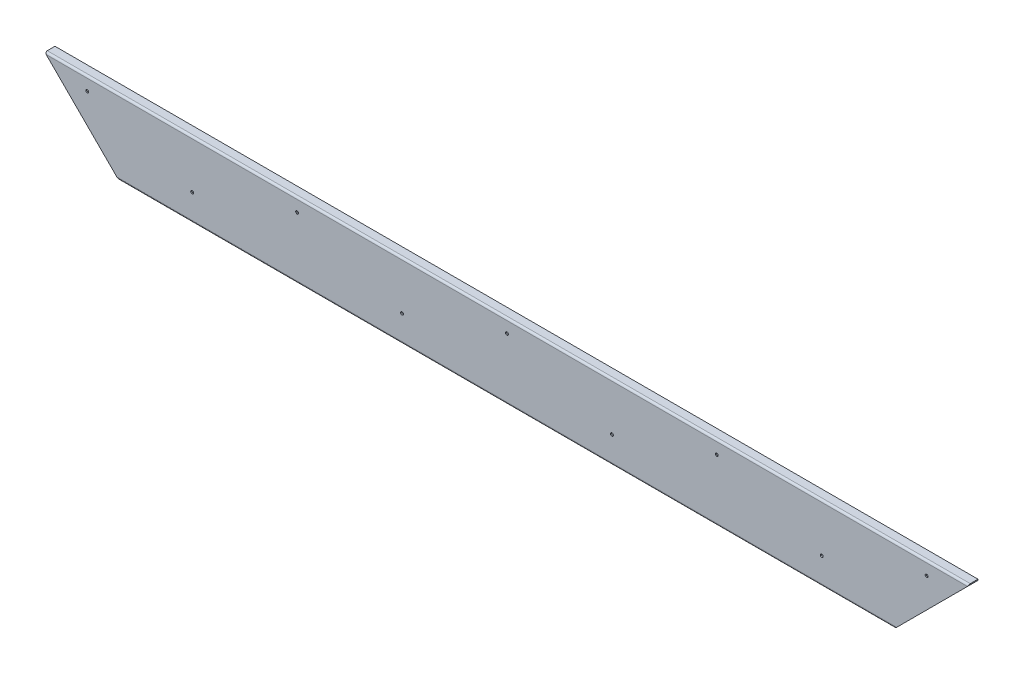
ISO-10303-21;
HEADER;
FILE_DESCRIPTION(('STEP AP214'),'2;1');
FILE_NAME('part.step','',(''),(''),'','','');
FILE_SCHEMA(('AUTOMOTIVE_DESIGN { 1 0 10303 214 1 1 1 1 }'));
ENDSEC;
DATA;
#1=APPLICATION_CONTEXT('core data for automotive mechanical design processes');
#2=APPLICATION_PROTOCOL_DEFINITION('international standard','automotive_design',2000,#1);
#3=PRODUCT_CONTEXT('',#1,'mechanical');
#4=PRODUCT('Part','Part','',(#3));
#5=PRODUCT_RELATED_PRODUCT_CATEGORY('part','',(#4));
#6=PRODUCT_DEFINITION_FORMATION('','',#4);
#7=PRODUCT_DEFINITION_CONTEXT('part definition',#1,'design');
#8=PRODUCT_DEFINITION('design','',#6,#7);
#9=PRODUCT_DEFINITION_SHAPE('','',#8);
#10=(LENGTH_UNIT() NAMED_UNIT(*) SI_UNIT(.MILLI.,.METRE.));
#11=(NAMED_UNIT(*) PLANE_ANGLE_UNIT() SI_UNIT($,.RADIAN.));
#12=(NAMED_UNIT(*) SI_UNIT($,.STERADIAN.) SOLID_ANGLE_UNIT());
#13=UNCERTAINTY_MEASURE_WITH_UNIT(LENGTH_MEASURE(1.E-05),#10,'distance_accuracy_value','');
#14=(GEOMETRIC_REPRESENTATION_CONTEXT(3) GLOBAL_UNCERTAINTY_ASSIGNED_CONTEXT((#13)) GLOBAL_UNIT_ASSIGNED_CONTEXT((#10,
#11,#12)) REPRESENTATION_CONTEXT('',''));
#15=CARTESIAN_POINT('',(0.,0.,0.));
#16=DIRECTION('',(0.,0.,1.));
#17=DIRECTION('',(1.,0.,0.));
#18=AXIS2_PLACEMENT_3D('',#15,#16,#17);
#19=CARTESIAN_POINT('',(0.,977.2,0.));
#20=DIRECTION('',(0.,1.,0.));
#21=DIRECTION('',(0.,0.,1.));
#22=AXIS2_PLACEMENT_3D('',#19,#20,#21);
#23=PLANE('',#22);
#24=DIRECTION('',(0.,0.,-1.));
#25=VECTOR('',#24,1.);
#26=CARTESIAN_POINT('',(414.5,977.2,-112.601000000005));
#27=LINE('',#26,#25);
#28=CARTESIAN_POINT('',(414.5,977.2,-91.8000000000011));
#29=VERTEX_POINT('',#28);
#30=CARTESIAN_POINT('',(414.5,977.2,-110.400000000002));
#31=VERTEX_POINT('',#30);
#32=EDGE_CURVE('E876',#29,#31,#27,.T.);
#33=ORIENTED_EDGE('',*,*,#32,.F.);
#34=DIRECTION('',(-1.,0.,0.));
#35=VECTOR('',#34,1.);
#36=CARTESIAN_POINT('',(417.,977.2,-91.8000000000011));
#37=LINE('',#36,#35);
#38=CARTESIAN_POINT('',(-414.5,977.2,-91.8000000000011));
#39=VERTEX_POINT('',#38);
#40=EDGE_CURVE('E677',#39,#29,#37,.F.);
#41=ORIENTED_EDGE('',*,*,#40,.F.);
#42=DIRECTION('',(0.,0.,1.));
#43=VECTOR('',#42,1.);
#44=CARTESIAN_POINT('',(-414.5,977.2,-112.601000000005));
#45=LINE('',#44,#43);
#46=CARTESIAN_POINT('',(-414.5,977.2,-110.400000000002));
#47=VERTEX_POINT('',#46);
#48=EDGE_CURVE('E814',#47,#39,#45,.T.);
#49=ORIENTED_EDGE('',*,*,#48,.F.);
#50=DIRECTION('',(1.,0.,0.));
#51=VECTOR('',#50,1.);
#52=CARTESIAN_POINT('',(417.,977.2,-110.400000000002));
#53=LINE('',#52,#51);
#54=EDGE_CURVE('E662',#31,#47,#53,.F.);
#55=ORIENTED_EDGE('',*,*,#54,.F.);
#56=EDGE_LOOP('',(#33,#41,#49,#55));
#57=FACE_BOUND('',#56,.T.);
#58=ADVANCED_FACE('F181',(#57),#23,.F.);
#59=CARTESIAN_POINT('',(0.,978.4,0.));
#60=DIRECTION('',(0.,1.,0.));
#61=DIRECTION('',(0.,0.,1.));
#62=AXIS2_PLACEMENT_3D('',#59,#60,#61);
#63=PLANE('',#62);
#64=DIRECTION('',(-1.,0.,0.));
#65=VECTOR('',#64,1.);
#66=CARTESIAN_POINT('',(417.,978.4,-91.8000000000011));
#67=LINE('',#66,#65);
#68=CARTESIAN_POINT('',(414.5,978.4,-91.8000000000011));
#69=VERTEX_POINT('',#68);
#70=CARTESIAN_POINT('',(-414.5,978.4,-91.8000000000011));
#71=VERTEX_POINT('',#70);
#72=EDGE_CURVE('E676',#69,#71,#67,.T.);
#73=ORIENTED_EDGE('',*,*,#72,.F.);
#74=DIRECTION('',(0.,0.,1.));
#75=VECTOR('',#74,1.);
#76=CARTESIAN_POINT('',(414.5,978.4,0.));
#77=LINE('',#76,#75);
#78=CARTESIAN_POINT('',(414.5,978.4,-110.400000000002));
#79=VERTEX_POINT('',#78);
#80=EDGE_CURVE('E873',#69,#79,#77,.F.);
#81=ORIENTED_EDGE('',*,*,#80,.T.);
#82=DIRECTION('',(1.,0.,0.));
#83=VECTOR('',#82,1.);
#84=CARTESIAN_POINT('',(417.,978.4,-110.400000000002));
#85=LINE('',#84,#83);
#86=CARTESIAN_POINT('',(-414.5,978.4,-110.400000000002));
#87=VERTEX_POINT('',#86);
#88=EDGE_CURVE('E673',#79,#87,#85,.F.);
#89=ORIENTED_EDGE('',*,*,#88,.T.);
#90=DIRECTION('',(0.,0.,1.));
#91=VECTOR('',#90,1.);
#92=CARTESIAN_POINT('',(-414.5,978.4,0.));
#93=LINE('',#92,#91);
#94=EDGE_CURVE('E830',#87,#71,#93,.T.);
#95=ORIENTED_EDGE('',*,*,#94,.T.);
#96=EDGE_LOOP('',(#73,#81,#89,#95));
#97=FACE_BOUND('',#96,.T.);
#98=ADVANCED_FACE('F845',(#97),#63,.T.);
#99=CARTESIAN_POINT('',(0.,2.78125241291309E-13,-90.8000000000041));
#100=DIRECTION('',(0.,0.,1.));
#101=DIRECTION('',(0.,-1.,0.));
#102=AXIS2_PLACEMENT_3D('',#99,#100,#101);
#103=PLANE('',#102);
#104=DIRECTION('',(0.707106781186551,0.707106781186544,0.));
#105=VECTOR('',#104,1.);
#106=CARTESIAN_POINT('',(533.1,1095.8,-90.8000000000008));
#107=LINE('',#106,#105);
#108=CARTESIAN_POINT('',(416.7,979.4,-90.8000000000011));
#109=VERTEX_POINT('',#108);
#110=CARTESIAN_POINT('',(427.3,990.,-90.8000000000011));
#111=VERTEX_POINT('',#110);
#112=EDGE_CURVE('E753',#109,#111,#107,.T.);
#113=ORIENTED_EDGE('',*,*,#112,.F.);
#114=DIRECTION('',(-1.,0.,0.));
#115=VECTOR('',#114,1.);
#116=CARTESIAN_POINT('',(-417.,979.4,-90.8000000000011));
#117=LINE('',#116,#115);
#118=CARTESIAN_POINT('',(-416.7,979.4,-90.8000000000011));
#119=VERTEX_POINT('',#118);
#120=EDGE_CURVE('E680',#119,#109,#117,.F.);
#121=ORIENTED_EDGE('',*,*,#120,.F.);
#122=DIRECTION('',(0.707106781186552,-0.707106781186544,0.));
#123=VECTOR('',#122,1.);
#124=CARTESIAN_POINT('',(-533.1,1095.8,-90.8000000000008));
#125=LINE('',#124,#123);
#126=CARTESIAN_POINT('',(-427.3,990.,-90.8000000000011));
#127=VERTEX_POINT('',#126);
#128=EDGE_CURVE('E819',#127,#119,#125,.T.);
#129=ORIENTED_EDGE('',*,*,#128,.F.);
#130=DIRECTION('',(1.,0.,0.));
#131=VECTOR('',#130,1.);
#132=CARTESIAN_POINT('',(-429.8,990.,-90.8000000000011));
#133=LINE('',#132,#131);
#134=EDGE_CURVE('E689',#111,#127,#133,.F.);
#135=ORIENTED_EDGE('',*,*,#134,.F.);
#136=EDGE_LOOP('',(#113,#121,#129,#135));
#137=FACE_BOUND('',#136,.T.);
#138=ADVANCED_FACE('F934',(#137),#103,.F.);
#139=CARTESIAN_POINT('',(0.,2.73935463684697E-13,-89.600000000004));
#140=DIRECTION('',(0.,0.,1.));
#141=DIRECTION('',(0.,-1.,0.));
#142=AXIS2_PLACEMENT_3D('',#139,#140,#141);
#143=PLANE('',#142);
#144=DIRECTION('',(-1.,0.,0.));
#145=VECTOR('',#144,1.);
#146=CARTESIAN_POINT('',(-417.,979.4,-89.6000000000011));
#147=LINE('',#146,#145);
#148=CARTESIAN_POINT('',(-416.7,979.4,-89.6000000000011));
#149=VERTEX_POINT('',#148);
#150=CARTESIAN_POINT('',(416.7,979.4,-89.6000000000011));
#151=VERTEX_POINT('',#150);
#152=EDGE_CURVE('E683',#149,#151,#147,.F.);
#153=ORIENTED_EDGE('',*,*,#152,.T.);
#154=DIRECTION('',(0.707106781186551,0.707106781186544,0.));
#155=VECTOR('',#154,1.);
#156=CARTESIAN_POINT('',(533.1,1095.8,-89.6000000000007));
#157=LINE('',#156,#155);
#158=CARTESIAN_POINT('',(427.3,990.,-89.6000000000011));
#159=VERTEX_POINT('',#158);
#160=EDGE_CURVE('E749',#151,#159,#157,.T.);
#161=ORIENTED_EDGE('',*,*,#160,.T.);
#162=DIRECTION('',(1.,0.,0.));
#163=VECTOR('',#162,1.);
#164=CARTESIAN_POINT('',(-429.8,990.,-89.6000000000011));
#165=LINE('',#164,#163);
#166=CARTESIAN_POINT('',(-427.3,990.,-89.6000000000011));
#167=VERTEX_POINT('',#166);
#168=EDGE_CURVE('E686',#167,#159,#165,.T.);
#169=ORIENTED_EDGE('',*,*,#168,.F.);
#170=DIRECTION('',(0.707106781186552,-0.707106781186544,0.));
#171=VECTOR('',#170,1.);
#172=CARTESIAN_POINT('',(-533.1,1095.8,-89.6000000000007));
#173=LINE('',#172,#171);
#174=EDGE_CURVE('E822',#167,#149,#173,.T.);
#175=ORIENTED_EDGE('',*,*,#174,.T.);
#176=EDGE_LOOP('',(#153,#161,#169,#175));
#177=FACE_BOUND('',#176,.T.);
#178=ADVANCED_FACE('F951',(#177),#143,.T.);
#179=CARTESIAN_POINT('',(0.,991.,0.));
#180=DIRECTION('',(0.,1.,0.));
#181=DIRECTION('',(0.,0.,1.));
#182=AXIS2_PLACEMENT_3D('',#179,#180,#181);
#183=PLANE('',#182);
#184=DIRECTION('',(0.,0.,-1.));
#185=VECTOR('',#184,1.);
#186=CARTESIAN_POINT('',(428.3,991.,-112.601000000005));
#187=LINE('',#186,#185);
#188=CARTESIAN_POINT('',(428.3,991.,-16.0000000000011));
#189=VERTEX_POINT('',#188);
#190=CARTESIAN_POINT('',(428.3,991.,-88.6000000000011));
#191=VERTEX_POINT('',#190);
#192=EDGE_CURVE('E742',#189,#191,#187,.T.);
#193=ORIENTED_EDGE('',*,*,#192,.F.);
#194=DIRECTION('',(-1.,0.,0.));
#195=VECTOR('',#194,1.);
#196=CARTESIAN_POINT('',(430.8,991.,-16.0000000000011));
#197=LINE('',#196,#195);
#198=CARTESIAN_POINT('',(-428.3,991.,-16.0000000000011));
#199=VERTEX_POINT('',#198);
#200=EDGE_CURVE('E701',#199,#189,#197,.F.);
#201=ORIENTED_EDGE('',*,*,#200,.F.);
#202=DIRECTION('',(0.,0.,1.));
#203=VECTOR('',#202,1.);
#204=CARTESIAN_POINT('',(-428.3,991.,-112.601000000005));
#205=LINE('',#204,#203);
#206=CARTESIAN_POINT('',(-428.300000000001,991.,-88.6000000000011));
#207=VERTEX_POINT('',#206);
#208=EDGE_CURVE('E514',#207,#199,#205,.T.);
#209=ORIENTED_EDGE('',*,*,#208,.F.);
#210=DIRECTION('',(1.,0.,0.));
#211=VECTOR('',#210,1.);
#212=CARTESIAN_POINT('',(430.8,991.,-88.6000000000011));
#213=LINE('',#212,#211);
#214=EDGE_CURVE('E692',#191,#207,#213,.F.);
#215=ORIENTED_EDGE('',*,*,#214,.F.);
#216=EDGE_LOOP('',(#193,#201,#209,#215));
#217=FACE_BOUND('',#216,.T.);
#218=ADVANCED_FACE('F955',(#217),#183,.F.);
#219=CARTESIAN_POINT('',(0.,992.2,0.));
#220=DIRECTION('',(0.,1.,0.));
#221=DIRECTION('',(0.,0.,1.));
#222=AXIS2_PLACEMENT_3D('',#219,#220,#221);
#223=PLANE('',#222);
#224=DIRECTION('',(-1.,0.,0.));
#225=VECTOR('',#224,1.);
#226=CARTESIAN_POINT('',(430.8,992.2,-16.0000000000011));
#227=LINE('',#226,#225);
#228=CARTESIAN_POINT('',(428.3,992.2,-16.0000000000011));
#229=VERTEX_POINT('',#228);
#230=CARTESIAN_POINT('',(-428.3,992.2,-16.0000000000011));
#231=VERTEX_POINT('',#230);
#232=EDGE_CURVE('E700',#229,#231,#227,.T.);
#233=ORIENTED_EDGE('',*,*,#232,.F.);
#234=DIRECTION('',(0.,0.,1.));
#235=VECTOR('',#234,1.);
#236=CARTESIAN_POINT('',(428.3,992.2,0.));
#237=LINE('',#236,#235);
#238=CARTESIAN_POINT('',(428.3,992.2,-88.6000000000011));
#239=VERTEX_POINT('',#238);
#240=EDGE_CURVE('E738',#229,#239,#237,.F.);
#241=ORIENTED_EDGE('',*,*,#240,.T.);
#242=DIRECTION('',(1.,0.,0.));
#243=VECTOR('',#242,1.);
#244=CARTESIAN_POINT('',(430.8,992.2,-88.6000000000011));
#245=LINE('',#244,#243);
#246=CARTESIAN_POINT('',(-428.300000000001,992.2,-88.6000000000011));
#247=VERTEX_POINT('',#246);
#248=EDGE_CURVE('E697',#239,#247,#245,.F.);
#249=ORIENTED_EDGE('',*,*,#248,.T.);
#250=DIRECTION('',(0.,0.,1.));
#251=VECTOR('',#250,1.);
#252=CARTESIAN_POINT('',(-428.300000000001,992.2,0.));
#253=LINE('',#252,#251);
#254=EDGE_CURVE('E510',#247,#231,#253,.T.);
#255=ORIENTED_EDGE('',*,*,#254,.T.);
#256=EDGE_LOOP('',(#233,#241,#249,#255));
#257=FACE_BOUND('',#256,.T.);
#258=ADVANCED_FACE('F967',(#257),#223,.T.);
#259=CARTESIAN_POINT('',(0.,0.,-15.0000000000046));
#260=DIRECTION('',(0.,0.,1.));
#261=DIRECTION('',(0.,-1.,0.));
#262=AXIS2_PLACEMENT_3D('',#259,#260,#261);
#263=PLANE('',#262);
#264=DIRECTION('',(0.707106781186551,0.707106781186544,0.));
#265=VECTOR('',#264,1.);
#266=CARTESIAN_POINT('',(533.1,1095.8,-15.0000000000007));
#267=LINE('',#266,#265);
#268=CARTESIAN_POINT('',(430.5,993.2,-15.0000000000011));
#269=VERTEX_POINT('',#268);
#270=CARTESIAN_POINT('',(441.1,1003.8,-15.000000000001));
#271=VERTEX_POINT('',#270);
#272=EDGE_CURVE('E729',#269,#271,#267,.T.);
#273=ORIENTED_EDGE('',*,*,#272,.F.);
#274=DIRECTION('',(-1.,0.,0.));
#275=VECTOR('',#274,1.);
#276=CARTESIAN_POINT('',(-430.8,993.2,-15.0000000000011));
#277=LINE('',#276,#275);
#278=CARTESIAN_POINT('',(-430.5,993.2,-15.0000000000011));
#279=VERTEX_POINT('',#278);
#280=EDGE_CURVE('E704',#279,#269,#277,.F.);
#281=ORIENTED_EDGE('',*,*,#280,.F.);
#282=DIRECTION('',(0.707106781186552,-0.707106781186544,0.));
#283=VECTOR('',#282,1.);
#284=CARTESIAN_POINT('',(-533.1,1095.8,-15.0000000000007));
#285=LINE('',#284,#283);
#286=CARTESIAN_POINT('',(-441.1,1003.8,-15.000000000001));
#287=VERTEX_POINT('',#286);
#288=EDGE_CURVE('E499',#287,#279,#285,.T.);
#289=ORIENTED_EDGE('',*,*,#288,.F.);
#290=DIRECTION('',(1.,0.,0.));
#291=VECTOR('',#290,1.);
#292=CARTESIAN_POINT('',(-443.6,1003.8,-15.000000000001));
#293=LINE('',#292,#291);
#294=EDGE_CURVE('E433',#271,#287,#293,.F.);
#295=ORIENTED_EDGE('',*,*,#294,.F.);
#296=EDGE_LOOP('',(#273,#281,#289,#295));
#297=FACE_BOUND('',#296,.T.);
#298=ADVANCED_FACE('F925',(#297),#263,.F.);
#299=CARTESIAN_POINT('',(0.,0.,-13.8000000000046));
#300=DIRECTION('',(0.,0.,1.));
#301=DIRECTION('',(0.,-1.,0.));
#302=AXIS2_PLACEMENT_3D('',#299,#300,#301);
#303=PLANE('',#302);
#304=DIRECTION('',(-1.,0.,0.));
#305=VECTOR('',#304,1.);
#306=CARTESIAN_POINT('',(-430.8,993.2,-13.8000000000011));
#307=LINE('',#306,#305);
#308=CARTESIAN_POINT('',(-430.5,993.2,-13.8000000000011));
#309=VERTEX_POINT('',#308);
#310=CARTESIAN_POINT('',(430.5,993.2,-13.8000000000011));
#311=VERTEX_POINT('',#310);
#312=EDGE_CURVE('E707',#309,#311,#307,.F.);
#313=ORIENTED_EDGE('',*,*,#312,.T.);
#314=DIRECTION('',(0.707106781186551,0.707106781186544,0.));
#315=VECTOR('',#314,1.);
#316=CARTESIAN_POINT('',(533.1,1095.8,-13.8000000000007));
#317=LINE('',#316,#315);
#318=CARTESIAN_POINT('',(441.1,1003.8,-13.800000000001));
#319=VERTEX_POINT('',#318);
#320=EDGE_CURVE('E725',#311,#319,#317,.T.);
#321=ORIENTED_EDGE('',*,*,#320,.T.);
#322=DIRECTION('',(1.,0.,0.));
#323=VECTOR('',#322,1.);
#324=CARTESIAN_POINT('',(-443.6,1003.8,-13.800000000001));
#325=LINE('',#324,#323);
#326=CARTESIAN_POINT('',(-441.1,1003.8,-13.800000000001));
#327=VERTEX_POINT('',#326);
#328=EDGE_CURVE('E710',#327,#319,#325,.T.);
#329=ORIENTED_EDGE('',*,*,#328,.F.);
#330=DIRECTION('',(0.707106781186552,-0.707106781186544,0.));
#331=VECTOR('',#330,1.);
#332=CARTESIAN_POINT('',(-533.1,1095.8,-13.8000000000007));
#333=LINE('',#332,#331);
#334=EDGE_CURVE('E502',#327,#309,#333,.T.);
#335=ORIENTED_EDGE('',*,*,#334,.T.);
#336=EDGE_LOOP('',(#313,#321,#329,#335));
#337=FACE_BOUND('',#336,.T.);
#338=ADVANCED_FACE('F722',(#337),#303,.T.);
#339=CARTESIAN_POINT('',(0.,1004.8,0.));
#340=DIRECTION('',(0.,1.,0.));
#341=DIRECTION('',(0.,0.,1.));
#342=AXIS2_PLACEMENT_3D('',#339,#340,#341);
#343=PLANE('',#342);
#344=DIRECTION('',(0.,0.,-1.));
#345=VECTOR('',#344,1.);
#346=CARTESIAN_POINT('',(442.1,1004.8,-112.601000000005));
#347=LINE('',#346,#345);
#348=CARTESIAN_POINT('',(442.1,1004.8,-2.19999999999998));
#349=VERTEX_POINT('',#348);
#350=CARTESIAN_POINT('',(442.1,1004.8,-12.800000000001));
#351=VERTEX_POINT('',#350);
#352=EDGE_CURVE('E413',#349,#351,#347,.T.);
#353=ORIENTED_EDGE('',*,*,#352,.F.);
#354=DIRECTION('',(-1.,0.,0.));
#355=VECTOR('',#354,1.);
#356=CARTESIAN_POINT('',(444.6,1004.8,-2.19999999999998));
#357=LINE('',#356,#355);
#358=CARTESIAN_POINT('',(-442.1,1004.8,-2.19999999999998));
#359=VERTEX_POINT('',#358);
#360=EDGE_CURVE('E430',#359,#349,#357,.F.);
#361=ORIENTED_EDGE('',*,*,#360,.F.);
#362=DIRECTION('',(0.,0.,1.));
#363=VECTOR('',#362,1.);
#364=CARTESIAN_POINT('',(-442.1,1004.8,-112.601000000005));
#365=LINE('',#364,#363);
#366=CARTESIAN_POINT('',(-442.1,1004.8,-12.800000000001));
#367=VERTEX_POINT('',#366);
#368=EDGE_CURVE('E491',#367,#359,#365,.T.);
#369=ORIENTED_EDGE('',*,*,#368,.F.);
#370=DIRECTION('',(1.,0.,0.));
#371=VECTOR('',#370,1.);
#372=CARTESIAN_POINT('',(444.6,1004.8,-12.800000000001));
#373=LINE('',#372,#371);
#374=EDGE_CURVE('E428',#351,#367,#373,.F.);
#375=ORIENTED_EDGE('',*,*,#374,.F.);
#376=EDGE_LOOP('',(#353,#361,#369,#375));
#377=FACE_BOUND('',#376,.T.);
#378=ADVANCED_FACE('F917',(#377),#343,.F.);
#379=CARTESIAN_POINT('',(0.,1006.,0.));
#380=DIRECTION('',(0.,1.,0.));
#381=DIRECTION('',(0.,0.,1.));
#382=AXIS2_PLACEMENT_3D('',#379,#380,#381);
#383=PLANE('',#382);
#384=DIRECTION('',(-1.,0.,0.));
#385=VECTOR('',#384,1.);
#386=CARTESIAN_POINT('',(444.6,1006.,-2.19999999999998));
#387=LINE('',#386,#385);
#388=CARTESIAN_POINT('',(442.1,1006.,-2.19999999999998));
#389=VERTEX_POINT('',#388);
#390=CARTESIAN_POINT('',(-442.1,1006.,-2.19999999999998));
#391=VERTEX_POINT('',#390);
#392=EDGE_CURVE('E423',#389,#391,#387,.T.);
#393=ORIENTED_EDGE('',*,*,#392,.F.);
#394=DIRECTION('',(0.,0.,1.));
#395=VECTOR('',#394,1.);
#396=CARTESIAN_POINT('',(442.1,1006.,0.));
#397=LINE('',#396,#395);
#398=CARTESIAN_POINT('',(442.1,1006.,-12.800000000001));
#399=VERTEX_POINT('',#398);
#400=EDGE_CURVE('E410',#389,#399,#397,.F.);
#401=ORIENTED_EDGE('',*,*,#400,.T.);
#402=DIRECTION('',(1.,0.,0.));
#403=VECTOR('',#402,1.);
#404=CARTESIAN_POINT('',(444.6,1006.,-12.800000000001));
#405=LINE('',#404,#403);
#406=CARTESIAN_POINT('',(-442.1,1006.,-12.800000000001));
#407=VERTEX_POINT('',#406);
#408=EDGE_CURVE('E421',#399,#407,#405,.F.);
#409=ORIENTED_EDGE('',*,*,#408,.T.);
#410=DIRECTION('',(0.,0.,1.));
#411=VECTOR('',#410,1.);
#412=CARTESIAN_POINT('',(-442.1,1006.,0.));
#413=LINE('',#412,#411);
#414=EDGE_CURVE('E488',#407,#391,#413,.T.);
#415=ORIENTED_EDGE('',*,*,#414,.T.);
#416=EDGE_LOOP('',(#393,#401,#409,#415));
#417=FACE_BOUND('',#416,.T.);
#418=ADVANCED_FACE('F419',(#417),#383,.T.);
#419=CARTESIAN_POINT('',(0.,0.,-1.2));
#420=DIRECTION('',(0.,0.,-1.));
#421=DIRECTION('',(-1.,0.,0.));
#422=AXIS2_PLACEMENT_3D('',#419,#420,#421);
#423=PLANE('',#422);
#424=CARTESIAN_POINT('',(478.400000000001,1074.8,-1.2));
#425=DIRECTION('',(0.,0.,-1.));
#426=DIRECTION('',(-1.,0.,0.));
#427=AXIS2_PLACEMENT_3D('',#424,#425,#426);
#428=CIRCLE('',#427,1.65000000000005);
#429=CARTESIAN_POINT('',(476.750000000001,1074.8,-1.2));
#430=VERTEX_POINT('',#429);
#431=EDGE_CURVE('E533',#430,#430,#428,.T.);
#432=ORIENTED_EDGE('',*,*,#431,.F.);
#433=EDGE_LOOP('',(#432));
#434=FACE_BOUND('',#433,.T.);
#435=CARTESIAN_POINT('',(-478.1,1074.8,-1.2));
#436=DIRECTION('',(0.,0.,-1.));
#437=DIRECTION('',(-1.,0.,0.));
#438=AXIS2_PLACEMENT_3D('',#435,#436,#437);
#439=CIRCLE('',#438,1.65000000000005);
#440=CARTESIAN_POINT('',(-479.75,1074.8,-1.2));
#441=VERTEX_POINT('',#440);
#442=EDGE_CURVE('E553',#441,#441,#439,.T.);
#443=ORIENTED_EDGE('',*,*,#442,.F.);
#444=EDGE_LOOP('',(#443));
#445=FACE_BOUND('',#444,.T.);
#446=CARTESIAN_POINT('',(119.712500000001,1035.,-1.2));
#447=DIRECTION('',(0.,0.,-1.));
#448=DIRECTION('',(-1.,0.,0.));
#449=AXIS2_PLACEMENT_3D('',#446,#447,#448);
#450=CIRCLE('',#449,1.65000000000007);
#451=CARTESIAN_POINT('',(118.062500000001,1035.,-1.2));
#452=VERTEX_POINT('',#451);
#453=EDGE_CURVE('E548',#452,#452,#450,.T.);
#454=ORIENTED_EDGE('',*,*,#453,.F.);
#455=EDGE_LOOP('',(#454));
#456=FACE_BOUND('',#455,.T.);
#457=CARTESIAN_POINT('',(-119.412499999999,1035.,-1.2));
#458=DIRECTION('',(0.,0.,-1.));
#459=DIRECTION('',(-1.,0.,0.));
#460=AXIS2_PLACEMENT_3D('',#457,#458,#459);
#461=CIRCLE('',#460,1.65000000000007);
#462=CARTESIAN_POINT('',(-121.062499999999,1035.,-1.2));
#463=VERTEX_POINT('',#462);
#464=EDGE_CURVE('E541',#463,#463,#461,.T.);
#465=ORIENTED_EDGE('',*,*,#464,.F.);
#466=EDGE_LOOP('',(#465));
#467=FACE_BOUND('',#466,.T.);
#468=CARTESIAN_POINT('',(-358.5375,1035.,-1.2));
#469=DIRECTION('',(0.,0.,-1.));
#470=DIRECTION('',(-1.,0.,0.));
#471=AXIS2_PLACEMENT_3D('',#468,#469,#470);
#472=CIRCLE('',#471,1.64999999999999);
#473=CARTESIAN_POINT('',(-360.1875,1035.,-1.2));
#474=VERTEX_POINT('',#473);
#475=EDGE_CURVE('E530',#474,#474,#472,.T.);
#476=ORIENTED_EDGE('',*,*,#475,.F.);
#477=EDGE_LOOP('',(#476));
#478=FACE_BOUND('',#477,.T.);
#479=CARTESIAN_POINT('',(-238.975,1074.8,-1.2));
#480=DIRECTION('',(0.,0.,-1.));
#481=DIRECTION('',(-1.,0.,0.));
#482=AXIS2_PLACEMENT_3D('',#479,#480,#481);
#483=CIRCLE('',#482,1.65000000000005);
#484=CARTESIAN_POINT('',(-240.625,1074.8,-1.2));
#485=VERTEX_POINT('',#484);
#486=EDGE_CURVE('E560',#485,#485,#483,.T.);
#487=ORIENTED_EDGE('',*,*,#486,.F.);
#488=EDGE_LOOP('',(#487));
#489=FACE_BOUND('',#488,.T.);
#490=CARTESIAN_POINT('',(0.150000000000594,1074.8,-1.2));
#491=DIRECTION('',(0.,0.,-1.));
#492=DIRECTION('',(-1.,0.,0.));
#493=AXIS2_PLACEMENT_3D('',#490,#491,#492);
#494=CIRCLE('',#493,1.65000000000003);
#495=CARTESIAN_POINT('',(-1.49999999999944,1074.8,-1.2));
#496=VERTEX_POINT('',#495);
#497=EDGE_CURVE('E577',#496,#496,#494,.T.);
#498=ORIENTED_EDGE('',*,*,#497,.F.);
#499=EDGE_LOOP('',(#498));
#500=FACE_BOUND('',#499,.T.);
#501=CARTESIAN_POINT('',(239.275000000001,1074.8,-1.2));
#502=DIRECTION('',(0.,0.,-1.));
#503=DIRECTION('',(-1.,0.,0.));
#504=AXIS2_PLACEMENT_3D('',#501,#502,#503);
#505=CIRCLE('',#504,1.64999999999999);
#506=CARTESIAN_POINT('',(237.625000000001,1074.8,-1.2));
#507=VERTEX_POINT('',#506);
#508=EDGE_CURVE('E571',#507,#507,#505,.T.);
#509=ORIENTED_EDGE('',*,*,#508,.F.);
#510=EDGE_LOOP('',(#509));
#511=FACE_BOUND('',#510,.T.);
#512=CARTESIAN_POINT('',(358.837500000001,1035.,-1.2));
#513=DIRECTION('',(0.,0.,-1.));
#514=DIRECTION('',(-1.,0.,0.));
#515=AXIS2_PLACEMENT_3D('',#512,#513,#514);
#516=CIRCLE('',#515,1.65000000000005);
#517=CARTESIAN_POINT('',(357.187500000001,1035.,-1.2));
#518=VERTEX_POINT('',#517);
#519=EDGE_CURVE('E565',#518,#518,#516,.T.);
#520=ORIENTED_EDGE('',*,*,#519,.F.);
#521=EDGE_LOOP('',(#520));
#522=FACE_BOUND('',#521,.T.);
#523=DIRECTION('',(1.,0.,0.));
#524=VECTOR('',#523,1.);
#525=CARTESIAN_POINT('',(528.4,1087.6,-1.20000000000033));
#526=LINE('',#525,#524);
#527=CARTESIAN_POINT('',(524.900000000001,1087.6,-1.20000000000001));
#528=VERTEX_POINT('',#527);
#529=CARTESIAN_POINT('',(-524.900000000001,1087.6,-1.20000000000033));
#530=VERTEX_POINT('',#529);
#531=EDGE_CURVE('E189',#528,#530,#526,.F.);
#532=ORIENTED_EDGE('',*,*,#531,.F.);
#533=DIRECTION('',(-0.707106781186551,-0.707106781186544,0.));
#534=VECTOR('',#533,1.);
#535=CARTESIAN_POINT('',(533.1,1095.8,-1.2));
#536=LINE('',#535,#534);
#537=CARTESIAN_POINT('',(444.3,1007.,-1.20000000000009));
#538=VERTEX_POINT('',#537);
#539=EDGE_CURVE('E471',#528,#538,#536,.T.);
#540=ORIENTED_EDGE('',*,*,#539,.T.);
#541=DIRECTION('',(-1.,0.,0.));
#542=VECTOR('',#541,1.);
#543=CARTESIAN_POINT('',(-444.6,1007.,-1.20000000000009));
#544=LINE('',#543,#542);
#545=CARTESIAN_POINT('',(-444.3,1007.,-1.20000000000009));
#546=VERTEX_POINT('',#545);
#547=EDGE_CURVE('E438',#546,#538,#544,.F.);
#548=ORIENTED_EDGE('',*,*,#547,.F.);
#549=DIRECTION('',(-0.707106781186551,0.707106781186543,0.));
#550=VECTOR('',#549,1.);
#551=CARTESIAN_POINT('',(-533.1,1095.8,-1.2));
#552=LINE('',#551,#550);
#553=EDGE_CURVE('E472',#546,#530,#552,.T.);
#554=ORIENTED_EDGE('',*,*,#553,.T.);
#555=EDGE_LOOP('',(#532,#540,#548,#554));
#556=FACE_BOUND('',#555,.T.);
#557=ADVANCED_FACE('F469',(#434,#445,#456,#467,#478,#489,#500,#511,#522,#556),#423,.T.);
#558=CARTESIAN_POINT('',(0.,0.,0.));
#559=DIRECTION('',(0.,0.,-1.));
#560=DIRECTION('',(-1.,0.,0.));
#561=AXIS2_PLACEMENT_3D('',#558,#559,#560);
#562=PLANE('',#561);
#563=CARTESIAN_POINT('',(478.400000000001,1074.8,0.));
#564=DIRECTION('',(0.,0.,-1.));
#565=DIRECTION('',(-1.,0.,0.));
#566=AXIS2_PLACEMENT_3D('',#563,#564,#565);
#567=CIRCLE('',#566,1.65000000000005);
#568=CARTESIAN_POINT('',(476.750000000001,1074.8,0.));
#569=VERTEX_POINT('',#568);
#570=EDGE_CURVE('E536',#569,#569,#567,.F.);
#571=ORIENTED_EDGE('',*,*,#570,.F.);
#572=EDGE_LOOP('',(#571));
#573=FACE_BOUND('',#572,.T.);
#574=CARTESIAN_POINT('',(-478.1,1074.8,0.));
#575=DIRECTION('',(0.,0.,-1.));
#576=DIRECTION('',(-1.,0.,0.));
#577=AXIS2_PLACEMENT_3D('',#574,#575,#576);
#578=CIRCLE('',#577,1.65000000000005);
#579=CARTESIAN_POINT('',(-479.75,1074.8,0.));
#580=VERTEX_POINT('',#579);
#581=EDGE_CURVE('E556',#580,#580,#578,.F.);
#582=ORIENTED_EDGE('',*,*,#581,.F.);
#583=EDGE_LOOP('',(#582));
#584=FACE_BOUND('',#583,.T.);
#585=CARTESIAN_POINT('',(119.712500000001,1035.,0.));
#586=DIRECTION('',(0.,0.,-1.));
#587=DIRECTION('',(-1.,0.,0.));
#588=AXIS2_PLACEMENT_3D('',#585,#586,#587);
#589=CIRCLE('',#588,1.65000000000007);
#590=CARTESIAN_POINT('',(118.062500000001,1035.,0.));
#591=VERTEX_POINT('',#590);
#592=EDGE_CURVE('E557',#591,#591,#589,.F.);
#593=ORIENTED_EDGE('',*,*,#592,.F.);
#594=EDGE_LOOP('',(#593));
#595=FACE_BOUND('',#594,.T.);
#596=CARTESIAN_POINT('',(-119.412499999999,1035.,0.));
#597=DIRECTION('',(0.,0.,-1.));
#598=DIRECTION('',(-1.,0.,0.));
#599=AXIS2_PLACEMENT_3D('',#596,#597,#598);
#600=CIRCLE('',#599,1.65000000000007);
#601=CARTESIAN_POINT('',(-121.062499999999,1035.,0.));
#602=VERTEX_POINT('',#601);
#603=EDGE_CURVE('E544',#602,#602,#600,.F.);
#604=ORIENTED_EDGE('',*,*,#603,.F.);
#605=EDGE_LOOP('',(#604));
#606=FACE_BOUND('',#605,.T.);
#607=CARTESIAN_POINT('',(-358.5375,1035.,0.));
#608=DIRECTION('',(0.,0.,-1.));
#609=DIRECTION('',(-1.,0.,0.));
#610=AXIS2_PLACEMENT_3D('',#607,#608,#609);
#611=CIRCLE('',#610,1.64999999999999);
#612=CARTESIAN_POINT('',(-360.1875,1035.,0.));
#613=VERTEX_POINT('',#612);
#614=EDGE_CURVE('E545',#613,#613,#611,.F.);
#615=ORIENTED_EDGE('',*,*,#614,.F.);
#616=EDGE_LOOP('',(#615));
#617=FACE_BOUND('',#616,.T.);
#618=CARTESIAN_POINT('',(-238.975,1074.8,0.));
#619=DIRECTION('',(0.,0.,-1.));
#620=DIRECTION('',(-1.,0.,0.));
#621=AXIS2_PLACEMENT_3D('',#618,#619,#620);
#622=CIRCLE('',#621,1.65000000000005);
#623=CARTESIAN_POINT('',(-240.625,1074.8,0.));
#624=VERTEX_POINT('',#623);
#625=EDGE_CURVE('E580',#624,#624,#622,.F.);
#626=ORIENTED_EDGE('',*,*,#625,.F.);
#627=EDGE_LOOP('',(#626));
#628=FACE_BOUND('',#627,.T.);
#629=CARTESIAN_POINT('',(0.150000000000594,1074.8,0.));
#630=DIRECTION('',(0.,0.,-1.));
#631=DIRECTION('',(-1.,0.,0.));
#632=AXIS2_PLACEMENT_3D('',#629,#630,#631);
#633=CIRCLE('',#632,1.65000000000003);
#634=CARTESIAN_POINT('',(-1.49999999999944,1074.8,0.));
#635=VERTEX_POINT('',#634);
#636=EDGE_CURVE('E574',#635,#635,#633,.F.);
#637=ORIENTED_EDGE('',*,*,#636,.F.);
#638=EDGE_LOOP('',(#637));
#639=FACE_BOUND('',#638,.T.);
#640=CARTESIAN_POINT('',(239.275000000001,1074.8,0.));
#641=DIRECTION('',(0.,0.,-1.));
#642=DIRECTION('',(-1.,0.,0.));
#643=AXIS2_PLACEMENT_3D('',#640,#641,#642);
#644=CIRCLE('',#643,1.64999999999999);
#645=CARTESIAN_POINT('',(237.625000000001,1074.8,0.));
#646=VERTEX_POINT('',#645);
#647=EDGE_CURVE('E568',#646,#646,#644,.F.);
#648=ORIENTED_EDGE('',*,*,#647,.F.);
#649=EDGE_LOOP('',(#648));
#650=FACE_BOUND('',#649,.T.);
#651=CARTESIAN_POINT('',(358.837500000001,1035.,0.));
#652=DIRECTION('',(0.,0.,-1.));
#653=DIRECTION('',(-1.,0.,0.));
#654=AXIS2_PLACEMENT_3D('',#651,#652,#653);
#655=CIRCLE('',#654,1.65000000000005);
#656=CARTESIAN_POINT('',(357.187500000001,1035.,0.));
#657=VERTEX_POINT('',#656);
#658=EDGE_CURVE('E537',#657,#657,#655,.F.);
#659=ORIENTED_EDGE('',*,*,#658,.F.);
#660=EDGE_LOOP('',(#659));
#661=FACE_BOUND('',#660,.T.);
#662=DIRECTION('',(-0.707106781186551,-0.707106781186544,0.));
#663=VECTOR('',#662,1.);
#664=CARTESIAN_POINT('',(533.1,1095.8,0.));
#665=LINE('',#664,#663);
#666=CARTESIAN_POINT('',(524.900000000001,1087.6,0.));
#667=VERTEX_POINT('',#666);
#668=CARTESIAN_POINT('',(444.3,1007.,0.));
#669=VERTEX_POINT('',#668);
#670=EDGE_CURVE('E790',#667,#669,#665,.T.);
#671=ORIENTED_EDGE('',*,*,#670,.F.);
#672=DIRECTION('',(1.,0.,0.));
#673=VECTOR('',#672,1.);
#674=CARTESIAN_POINT('',(528.4,1087.6,-3.34801630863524E-13));
#675=LINE('',#674,#673);
#676=CARTESIAN_POINT('',(-524.900000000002,1087.6,-3.34801630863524E-13));
#677=VERTEX_POINT('',#676);
#678=EDGE_CURVE('E13',#667,#677,#675,.F.);
#679=ORIENTED_EDGE('',*,*,#678,.T.);
#680=DIRECTION('',(-0.707106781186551,0.707106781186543,0.));
#681=VECTOR('',#680,1.);
#682=CARTESIAN_POINT('',(-533.1,1095.8,0.));
#683=LINE('',#682,#681);
#684=CARTESIAN_POINT('',(-444.3,1007.,0.));
#685=VERTEX_POINT('',#684);
#686=EDGE_CURVE('E476',#685,#677,#683,.T.);
#687=ORIENTED_EDGE('',*,*,#686,.F.);
#688=DIRECTION('',(-1.,0.,0.));
#689=VECTOR('',#688,1.);
#690=CARTESIAN_POINT('',(-444.6,1007.,0.));
#691=LINE('',#690,#689);
#692=EDGE_CURVE('E440',#685,#669,#691,.F.);
#693=ORIENTED_EDGE('',*,*,#692,.T.);
#694=EDGE_LOOP('',(#671,#679,#687,#693));
#695=FACE_BOUND('',#694,.T.);
#696=ADVANCED_FACE('F183',(#573,#584,#595,#606,#617,#628,#639,#650,#661,#695),#562,.F.);
#697=CARTESIAN_POINT('',(528.4,1087.6,-2.2));
#698=DIRECTION('',(1.,0.,0.));
#699=DIRECTION('',(0.,1.,0.));
#700=AXIS2_PLACEMENT_3D('',#697,#698,#699);
#701=CYLINDRICAL_SURFACE('',#700,2.19999999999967);
#702=ORIENTED_EDGE('',*,*,#678,.F.);
#703=CARTESIAN_POINT('',(524.900000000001,1087.6,-2.2));
#704=DIRECTION('',(-0.910366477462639,0.413802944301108,0.));
#705=DIRECTION('',(0.413802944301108,0.910366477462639,0.));
#706=AXIS2_PLACEMENT_3D('',#703,#704,#705);
#707=ELLIPSE('',#706,2.41660919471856,2.19999999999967);
#708=CARTESIAN_POINT('',(525.900000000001,1089.8,-2.19999999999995));
#709=VERTEX_POINT('',#708);
#710=EDGE_CURVE('E887',#667,#709,#707,.T.);
#711=ORIENTED_EDGE('',*,*,#710,.T.);
#712=DIRECTION('',(1.,0.,0.));
#713=VECTOR('',#712,1.);
#714=CARTESIAN_POINT('',(-4.58086531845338E-13,1089.8,-2.19999999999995));
#715=LINE('',#714,#713);
#716=CARTESIAN_POINT('',(-525.900000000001,1089.8,-2.19999999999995));
#717=VERTEX_POINT('',#716);
#718=EDGE_CURVE('E452',#717,#709,#715,.T.);
#719=ORIENTED_EDGE('',*,*,#718,.F.);
#720=CARTESIAN_POINT('',(-524.900000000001,1087.6,-2.2));
#721=DIRECTION('',(0.91036647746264,0.413802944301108,0.));
#722=DIRECTION('',(0.413802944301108,-0.910366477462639,0.));
#723=AXIS2_PLACEMENT_3D('',#720,#721,#722);
#724=ELLIPSE('',#723,2.41660919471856,2.19999999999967);
#725=EDGE_CURVE('E811',#717,#677,#724,.T.);
#726=ORIENTED_EDGE('',*,*,#725,.T.);
#727=EDGE_LOOP('',(#702,#711,#719,#726));
#728=FACE_BOUND('',#727,.T.);
#729=ADVANCED_FACE('F1668',(#728),#701,.T.);
#730=CARTESIAN_POINT('',(528.4,1087.6,-2.2));
#731=DIRECTION('',(1.,0.,0.));
#732=DIRECTION('',(0.,1.,0.));
#733=AXIS2_PLACEMENT_3D('',#730,#731,#732);
#734=CYLINDRICAL_SURFACE('',#733,0.999999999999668);
#735=CARTESIAN_POINT('',(524.900000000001,1087.6,-2.2));
#736=DIRECTION('',(-0.707106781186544,0.707106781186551,0.));
#737=DIRECTION('',(0.707106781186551,0.707106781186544,0.));
#738=AXIS2_PLACEMENT_3D('',#735,#736,#737);
#739=ELLIPSE('',#738,1.41421356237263,0.999999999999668);
#740=CARTESIAN_POINT('',(525.900000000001,1088.6,-2.19999999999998));
#741=VERTEX_POINT('',#740);
#742=EDGE_CURVE('E465',#528,#741,#739,.T.);
#743=ORIENTED_EDGE('',*,*,#742,.F.);
#744=ORIENTED_EDGE('',*,*,#531,.T.);
#745=CARTESIAN_POINT('',(-524.900000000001,1087.6,-2.2));
#746=DIRECTION('',(0.707106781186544,0.707106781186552,0.));
#747=DIRECTION('',(0.707106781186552,-0.707106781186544,0.));
#748=AXIS2_PLACEMENT_3D('',#745,#746,#747);
#749=ELLIPSE('',#748,1.41421356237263,0.999999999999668);
#750=CARTESIAN_POINT('',(-525.900000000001,1088.6,-2.19999999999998));
#751=VERTEX_POINT('',#750);
#752=EDGE_CURVE('E463',#751,#530,#749,.T.);
#753=ORIENTED_EDGE('',*,*,#752,.F.);
#754=DIRECTION('',(-1.,0.,0.));
#755=VECTOR('',#754,1.);
#756=CARTESIAN_POINT('',(-528.1,1088.6,-2.19999999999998));
#757=LINE('',#756,#755);
#758=EDGE_CURVE('E443',#751,#741,#757,.F.);
#759=ORIENTED_EDGE('',*,*,#758,.T.);
#760=EDGE_LOOP('',(#743,#744,#753,#759));
#761=FACE_BOUND('',#760,.T.);
#762=ADVANCED_FACE('F461',(#761),#734,.F.);
#763=CARTESIAN_POINT('',(-4.58086531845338E-13,1089.8,2.46964561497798E-11));
#764=DIRECTION('',(0.,1.,0.));
#765=DIRECTION('',(0.,0.,1.));
#766=AXIS2_PLACEMENT_3D('',#763,#764,#765);
#767=PLANE('',#766);
#768=ORIENTED_EDGE('',*,*,#718,.T.);
#769=DIRECTION('',(0.,0.,1.));
#770=VECTOR('',#769,1.);
#771=CARTESIAN_POINT('',(525.900000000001,1089.8,2.47194555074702E-11));
#772=LINE('',#771,#770);
#773=CARTESIAN_POINT('',(525.900000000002,1089.8,-11.));
#774=VERTEX_POINT('',#773);
#775=EDGE_CURVE('E797',#709,#774,#772,.F.);
#776=ORIENTED_EDGE('',*,*,#775,.T.);
#777=DIRECTION('',(1.,0.,0.));
#778=VECTOR('',#777,1.);
#779=CARTESIAN_POINT('',(528.4,1089.8,-11.));
#780=LINE('',#779,#778);
#781=CARTESIAN_POINT('',(-525.900000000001,1089.8,-11.));
#782=VERTEX_POINT('',#781);
#783=EDGE_CURVE('E446',#782,#774,#780,.T.);
#784=ORIENTED_EDGE('',*,*,#783,.F.);
#785=DIRECTION('',(0.,0.,1.));
#786=VECTOR('',#785,1.);
#787=CARTESIAN_POINT('',(-525.900000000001,1089.8,2.47194555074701E-11));
#788=LINE('',#787,#786);
#789=EDGE_CURVE('E522',#782,#717,#788,.T.);
#790=ORIENTED_EDGE('',*,*,#789,.T.);
#791=EDGE_LOOP('',(#768,#776,#784,#790));
#792=FACE_BOUND('',#791,.T.);
#793=ADVANCED_FACE('F1690',(#792),#767,.T.);
#794=CARTESIAN_POINT('',(-4.57331848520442E-13,1088.6,2.46922663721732E-11));
#795=DIRECTION('',(0.,1.,0.));
#796=DIRECTION('',(0.,0.,1.));
#797=AXIS2_PLACEMENT_3D('',#794,#795,#796);
#798=PLANE('',#797);
#799=DIRECTION('',(0.,0.,-1.));
#800=VECTOR('',#799,1.);
#801=CARTESIAN_POINT('',(525.900000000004,1088.6,-112.601000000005));
#802=LINE('',#801,#800);
#803=CARTESIAN_POINT('',(525.900000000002,1088.6,-11.));
#804=VERTEX_POINT('',#803);
#805=EDGE_CURVE('E801',#741,#804,#802,.T.);
#806=ORIENTED_EDGE('',*,*,#805,.F.);
#807=ORIENTED_EDGE('',*,*,#758,.F.);
#808=DIRECTION('',(0.,0.,1.));
#809=VECTOR('',#808,1.);
#810=CARTESIAN_POINT('',(-525.900000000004,1088.6,-112.601000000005));
#811=LINE('',#810,#809);
#812=CARTESIAN_POINT('',(-525.900000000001,1088.6,-11.));
#813=VERTEX_POINT('',#812);
#814=EDGE_CURVE('E486',#813,#751,#811,.T.);
#815=ORIENTED_EDGE('',*,*,#814,.F.);
#816=DIRECTION('',(-1.,0.,0.));
#817=VECTOR('',#816,1.);
#818=CARTESIAN_POINT('',(-4.57331848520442E-13,1088.6,-11.));
#819=LINE('',#818,#817);
#820=EDGE_CURVE('E449',#813,#804,#819,.F.);
#821=ORIENTED_EDGE('',*,*,#820,.T.);
#822=EDGE_LOOP('',(#806,#807,#815,#821));
#823=FACE_BOUND('',#822,.T.);
#824=ADVANCED_FACE('F1701',(#823),#798,.F.);
#825=CARTESIAN_POINT('',(528.4,1089.8,-11.));
#826=DIRECTION('',(0.,0.,-1.));
#827=DIRECTION('',(0.,1.,0.));
#828=AXIS2_PLACEMENT_3D('',#825,#826,#827);
#829=PLANE('',#828);
#830=ORIENTED_EDGE('',*,*,#783,.T.);
#831=DIRECTION('',(0.,-1.,0.));
#832=VECTOR('',#831,1.);
#833=CARTESIAN_POINT('',(525.900000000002,1088.6,-11.));
#834=LINE('',#833,#832);
#835=EDGE_CURVE('E800',#804,#774,#834,.F.);
#836=ORIENTED_EDGE('',*,*,#835,.F.);
#837=ORIENTED_EDGE('',*,*,#820,.F.);
#838=DIRECTION('',(0.,-1.,0.));
#839=VECTOR('',#838,1.);
#840=CARTESIAN_POINT('',(-525.900000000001,1088.6,-11.));
#841=LINE('',#840,#839);
#842=EDGE_CURVE('E527',#813,#782,#841,.F.);
#843=ORIENTED_EDGE('',*,*,#842,.T.);
#844=EDGE_LOOP('',(#830,#836,#837,#843));
#845=FACE_BOUND('',#844,.T.);
#846=ADVANCED_FACE('F1713',(#845),#829,.T.);
#847=CARTESIAN_POINT('',(-444.6,1007.,-2.19999999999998));
#848=DIRECTION('',(-1.,0.,0.));
#849=DIRECTION('',(0.,-1.,0.));
#850=AXIS2_PLACEMENT_3D('',#847,#848,#849);
#851=CYLINDRICAL_SURFACE('',#850,2.19999999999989);
#852=ORIENTED_EDGE('',*,*,#360,.T.);
#853=CARTESIAN_POINT('',(444.3,1007.,-2.19999999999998));
#854=DIRECTION('',(-0.707106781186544,0.707106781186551,0.));
#855=DIRECTION('',(-0.707106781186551,-0.707106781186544,0.));
#856=AXIS2_PLACEMENT_3D('',#853,#854,#855);
#857=ELLIPSE('',#856,3.11126983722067,2.19999999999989);
#858=EDGE_CURVE('E403',#349,#669,#857,.T.);
#859=ORIENTED_EDGE('',*,*,#858,.T.);
#860=ORIENTED_EDGE('',*,*,#692,.F.);
#861=CARTESIAN_POINT('',(-444.3,1007.,-2.19999999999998));
#862=DIRECTION('',(0.707106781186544,0.707106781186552,0.));
#863=DIRECTION('',(-0.707106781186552,0.707106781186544,0.));
#864=AXIS2_PLACEMENT_3D('',#861,#862,#863);
#865=ELLIPSE('',#864,3.11126983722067,2.19999999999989);
#866=EDGE_CURVE('E762',#685,#359,#865,.T.);
#867=ORIENTED_EDGE('',*,*,#866,.T.);
#868=EDGE_LOOP('',(#852,#859,#860,#867));
#869=FACE_BOUND('',#868,.T.);
#870=ADVANCED_FACE('F915',(#869),#851,.T.);
#871=CARTESIAN_POINT('',(-444.6,1007.,-2.19999999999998));
#872=DIRECTION('',(-1.,0.,0.));
#873=DIRECTION('',(0.,-1.,0.));
#874=AXIS2_PLACEMENT_3D('',#871,#872,#873);
#875=CYLINDRICAL_SURFACE('',#874,0.99999999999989);
#876=CARTESIAN_POINT('',(444.3,1007.,-2.19999999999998));
#877=DIRECTION('',(-0.413802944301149,0.91036647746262,0.));
#878=DIRECTION('',(-0.91036647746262,-0.413802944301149,0.));
#879=AXIS2_PLACEMENT_3D('',#876,#877,#878);
#880=ELLIPSE('',#879,2.41660919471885,0.99999999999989);
#881=EDGE_CURVE('E893',#389,#538,#880,.T.);
#882=ORIENTED_EDGE('',*,*,#881,.F.);
#883=ORIENTED_EDGE('',*,*,#392,.T.);
#884=CARTESIAN_POINT('',(-444.3,1007.,-2.19999999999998));
#885=DIRECTION('',(0.413802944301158,0.910366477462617,0.));
#886=DIRECTION('',(-0.910366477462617,0.413802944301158,0.));
#887=AXIS2_PLACEMENT_3D('',#884,#885,#886);
#888=ELLIPSE('',#887,2.4166091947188,0.99999999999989);
#889=EDGE_CURVE('E760',#546,#391,#888,.T.);
#890=ORIENTED_EDGE('',*,*,#889,.F.);
#891=ORIENTED_EDGE('',*,*,#547,.T.);
#892=EDGE_LOOP('',(#882,#883,#890,#891));
#893=FACE_BOUND('',#892,.T.);
#894=ADVANCED_FACE('F902',(#893),#875,.F.);
#895=CARTESIAN_POINT('',(444.6,1003.8,-12.800000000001));
#896=DIRECTION('',(1.,0.,0.));
#897=DIRECTION('',(0.,0.,-1.));
#898=AXIS2_PLACEMENT_3D('',#895,#896,#897);
#899=CYLINDRICAL_SURFACE('',#898,2.20000000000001);
#900=ORIENTED_EDGE('',*,*,#408,.F.);
#901=CARTESIAN_POINT('',(441.1,1003.8,-12.800000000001));
#902=DIRECTION('',(-0.910366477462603,0.413802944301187,0.));
#903=DIRECTION('',(0.413802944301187,0.910366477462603,0.));
#904=AXIS2_PLACEMENT_3D('',#901,#902,#903);
#905=ELLIPSE('',#904,2.4166091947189,2.20000000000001);
#906=EDGE_CURVE('E391',#399,#271,#905,.T.);
#907=ORIENTED_EDGE('',*,*,#906,.T.);
#908=ORIENTED_EDGE('',*,*,#294,.T.);
#909=CARTESIAN_POINT('',(-441.1,1003.8,-12.800000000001));
#910=DIRECTION('',(0.910366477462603,0.413802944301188,0.));
#911=DIRECTION('',(0.413802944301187,-0.910366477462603,0.));
#912=AXIS2_PLACEMENT_3D('',#909,#910,#911);
#913=ELLIPSE('',#912,2.4166091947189,2.20000000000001);
#914=EDGE_CURVE('E427',#287,#407,#913,.T.);
#915=ORIENTED_EDGE('',*,*,#914,.T.);
#916=EDGE_LOOP('',(#900,#907,#908,#915));
#917=FACE_BOUND('',#916,.T.);
#918=ADVANCED_FACE('F426',(#917),#899,.T.);
#919=CARTESIAN_POINT('',(444.6,1003.8,-12.800000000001));
#920=DIRECTION('',(1.,0.,0.));
#921=DIRECTION('',(0.,0.,-1.));
#922=AXIS2_PLACEMENT_3D('',#919,#920,#921);
#923=CYLINDRICAL_SURFACE('',#922,1.00000000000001);
#924=CARTESIAN_POINT('',(441.1,1003.8,-12.800000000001));
#925=DIRECTION('',(-0.707106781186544,0.707106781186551,0.));
#926=DIRECTION('',(0.707106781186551,0.707106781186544,0.));
#927=AXIS2_PLACEMENT_3D('',#924,#925,#926);
#928=ELLIPSE('',#927,1.41421356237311,1.00000000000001);
#929=EDGE_CURVE('E404',#351,#319,#928,.T.);
#930=ORIENTED_EDGE('',*,*,#929,.F.);
#931=ORIENTED_EDGE('',*,*,#374,.T.);
#932=CARTESIAN_POINT('',(-441.1,1003.8,-12.800000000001));
#933=DIRECTION('',(0.707106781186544,0.707106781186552,0.));
#934=DIRECTION('',(0.707106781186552,-0.707106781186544,0.));
#935=AXIS2_PLACEMENT_3D('',#932,#933,#934);
#936=ELLIPSE('',#935,1.41421356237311,1.00000000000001);
#937=EDGE_CURVE('E719',#327,#367,#936,.T.);
#938=ORIENTED_EDGE('',*,*,#937,.F.);
#939=ORIENTED_EDGE('',*,*,#328,.T.);
#940=EDGE_LOOP('',(#930,#931,#938,#939));
#941=FACE_BOUND('',#940,.T.);
#942=ADVANCED_FACE('F717',(#941),#923,.F.);
#943=CARTESIAN_POINT('',(-430.8,993.2,-16.0000000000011));
#944=DIRECTION('',(-1.,0.,0.));
#945=DIRECTION('',(0.,-1.,0.));
#946=AXIS2_PLACEMENT_3D('',#943,#944,#945);
#947=CYLINDRICAL_SURFACE('',#946,2.2);
#948=ORIENTED_EDGE('',*,*,#200,.T.);
#949=CARTESIAN_POINT('',(430.5,993.2,-16.0000000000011));
#950=DIRECTION('',(-0.707106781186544,0.707106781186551,0.));
#951=DIRECTION('',(-0.707106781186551,-0.707106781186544,0.));
#952=AXIS2_PLACEMENT_3D('',#949,#950,#951);
#953=ELLIPSE('',#952,3.11126983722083,2.2);
#954=EDGE_CURVE('E2216',#189,#311,#953,.T.);
#955=ORIENTED_EDGE('',*,*,#954,.T.);
#956=ORIENTED_EDGE('',*,*,#312,.F.);
#957=CARTESIAN_POINT('',(-430.5,993.2,-16.0000000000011));
#958=DIRECTION('',(0.707106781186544,0.707106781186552,0.));
#959=DIRECTION('',(-0.707106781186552,0.707106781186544,0.));
#960=AXIS2_PLACEMENT_3D('',#957,#958,#959);
#961=ELLIPSE('',#960,3.11126983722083,2.2);
#962=EDGE_CURVE('E769',#309,#199,#961,.T.);
#963=ORIENTED_EDGE('',*,*,#962,.T.);
#964=EDGE_LOOP('',(#948,#955,#956,#963));
#965=FACE_BOUND('',#964,.T.);
#966=ADVANCED_FACE('F972',(#965),#947,.T.);
#967=CARTESIAN_POINT('',(-430.8,993.2,-16.0000000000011));
#968=DIRECTION('',(-1.,0.,0.));
#969=DIRECTION('',(0.,-1.,0.));
#970=AXIS2_PLACEMENT_3D('',#967,#968,#969);
#971=CYLINDRICAL_SURFACE('',#970,1.);
#972=CARTESIAN_POINT('',(430.5,993.2,-16.0000000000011));
#973=DIRECTION('',(-0.41380294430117,0.910366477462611,0.));
#974=DIRECTION('',(-0.910366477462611,-0.41380294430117,0.));
#975=AXIS2_PLACEMENT_3D('',#972,#973,#974);
#976=ELLIPSE('',#975,2.416609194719,1.);
#977=EDGE_CURVE('E2223',#229,#269,#976,.T.);
#978=ORIENTED_EDGE('',*,*,#977,.F.);
#979=ORIENTED_EDGE('',*,*,#232,.T.);
#980=CARTESIAN_POINT('',(-430.5,993.2,-16.0000000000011));
#981=DIRECTION('',(0.413802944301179,0.910366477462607,0.));
#982=DIRECTION('',(-0.910366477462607,0.413802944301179,0.));
#983=AXIS2_PLACEMENT_3D('',#980,#981,#982);
#984=ELLIPSE('',#983,2.41660919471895,1.);
#985=EDGE_CURVE('E767',#279,#231,#984,.T.);
#986=ORIENTED_EDGE('',*,*,#985,.F.);
#987=ORIENTED_EDGE('',*,*,#280,.T.);
#988=EDGE_LOOP('',(#978,#979,#986,#987));
#989=FACE_BOUND('',#988,.T.);
#990=ADVANCED_FACE('F960',(#989),#971,.F.);
#991=CARTESIAN_POINT('',(430.8,990.,-88.6000000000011));
#992=DIRECTION('',(1.,0.,0.));
#993=DIRECTION('',(0.,0.,-1.));
#994=AXIS2_PLACEMENT_3D('',#991,#992,#993);
#995=CYLINDRICAL_SURFACE('',#994,2.2);
#996=ORIENTED_EDGE('',*,*,#248,.F.);
#997=CARTESIAN_POINT('',(427.3,990.,-88.6000000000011));
#998=DIRECTION('',(-0.910366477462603,0.413802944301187,0.));
#999=DIRECTION('',(0.413802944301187,0.910366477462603,0.));
#1000=AXIS2_PLACEMENT_3D('',#997,#998,#999);
#1001=ELLIPSE('',#1000,2.4166091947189,2.2);
#1002=EDGE_CURVE('E861',#239,#111,#1001,.T.);
#1003=ORIENTED_EDGE('',*,*,#1002,.T.);
#1004=ORIENTED_EDGE('',*,*,#134,.T.);
#1005=CARTESIAN_POINT('',(-427.3,990.,-88.6000000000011));
#1006=DIRECTION('',(0.910366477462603,0.413802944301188,0.));
#1007=DIRECTION('',(0.413802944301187,-0.910366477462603,0.));
#1008=AXIS2_PLACEMENT_3D('',#1005,#1006,#1007);
#1009=ELLIPSE('',#1008,2.4166091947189,2.2);
#1010=EDGE_CURVE('E772',#127,#247,#1009,.T.);
#1011=ORIENTED_EDGE('',*,*,#1010,.T.);
#1012=EDGE_LOOP('',(#996,#1003,#1004,#1011));
#1013=FACE_BOUND('',#1012,.T.);
#1014=ADVANCED_FACE('F957',(#1013),#995,.T.);
#1015=CARTESIAN_POINT('',(430.8,990.,-88.6000000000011));
#1016=DIRECTION('',(1.,0.,0.));
#1017=DIRECTION('',(0.,0.,-1.));
#1018=AXIS2_PLACEMENT_3D('',#1015,#1016,#1017);
#1019=CYLINDRICAL_SURFACE('',#1018,1.);
#1020=CARTESIAN_POINT('',(427.3,990.,-88.6000000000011));
#1021=DIRECTION('',(-0.707106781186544,0.707106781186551,0.));
#1022=DIRECTION('',(0.707106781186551,0.707106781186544,0.));
#1023=AXIS2_PLACEMENT_3D('',#1020,#1021,#1022);
#1024=ELLIPSE('',#1023,1.4142135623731,1.);
#1025=EDGE_CURVE('E857',#191,#159,#1024,.T.);
#1026=ORIENTED_EDGE('',*,*,#1025,.F.);
#1027=ORIENTED_EDGE('',*,*,#214,.T.);
#1028=CARTESIAN_POINT('',(-427.3,990.,-88.6000000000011));
#1029=DIRECTION('',(0.707106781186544,0.707106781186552,0.));
#1030=DIRECTION('',(0.707106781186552,-0.707106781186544,0.));
#1031=AXIS2_PLACEMENT_3D('',#1028,#1029,#1030);
#1032=ELLIPSE('',#1031,1.4142135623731,1.);
#1033=EDGE_CURVE('E775',#167,#207,#1032,.T.);
#1034=ORIENTED_EDGE('',*,*,#1033,.F.);
#1035=ORIENTED_EDGE('',*,*,#168,.T.);
#1036=EDGE_LOOP('',(#1026,#1027,#1034,#1035));
#1037=FACE_BOUND('',#1036,.T.);
#1038=ADVANCED_FACE('F944',(#1037),#1019,.F.);
#1039=CARTESIAN_POINT('',(-417.,979.4,-91.8000000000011));
#1040=DIRECTION('',(-1.,0.,0.));
#1041=DIRECTION('',(0.,-1.,0.));
#1042=AXIS2_PLACEMENT_3D('',#1039,#1040,#1041);
#1043=CYLINDRICAL_SURFACE('',#1042,2.2);
#1044=ORIENTED_EDGE('',*,*,#40,.T.);
#1045=CARTESIAN_POINT('',(416.7,979.4,-91.8000000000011));
#1046=DIRECTION('',(-0.707106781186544,0.707106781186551,0.));
#1047=DIRECTION('',(-0.707106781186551,-0.707106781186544,0.));
#1048=AXIS2_PLACEMENT_3D('',#1045,#1046,#1047);
#1049=ELLIPSE('',#1048,3.11126983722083,2.2);
#1050=EDGE_CURVE('E858',#29,#151,#1049,.T.);
#1051=ORIENTED_EDGE('',*,*,#1050,.T.);
#1052=ORIENTED_EDGE('',*,*,#152,.F.);
#1053=CARTESIAN_POINT('',(-416.7,979.4,-91.8000000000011));
#1054=DIRECTION('',(0.707106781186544,0.707106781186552,0.));
#1055=DIRECTION('',(-0.707106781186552,0.707106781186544,0.));
#1056=AXIS2_PLACEMENT_3D('',#1053,#1054,#1055);
#1057=ELLIPSE('',#1056,3.11126983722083,2.2);
#1058=EDGE_CURVE('E779',#149,#39,#1057,.T.);
#1059=ORIENTED_EDGE('',*,*,#1058,.T.);
#1060=EDGE_LOOP('',(#1044,#1051,#1052,#1059));
#1061=FACE_BOUND('',#1060,.T.);
#1062=ADVANCED_FACE('F941',(#1061),#1043,.T.);
#1063=CARTESIAN_POINT('',(-417.,979.4,-91.8000000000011));
#1064=DIRECTION('',(-1.,0.,0.));
#1065=DIRECTION('',(0.,-1.,0.));
#1066=AXIS2_PLACEMENT_3D('',#1063,#1064,#1065);
#1067=CYLINDRICAL_SURFACE('',#1066,1.);
#1068=CARTESIAN_POINT('',(416.7,979.4,-91.8000000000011));
#1069=DIRECTION('',(-0.41380294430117,0.910366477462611,0.));
#1070=DIRECTION('',(-0.910366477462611,-0.41380294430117,0.));
#1071=AXIS2_PLACEMENT_3D('',#1068,#1069,#1070);
#1072=ELLIPSE('',#1071,2.416609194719,1.);
#1073=EDGE_CURVE('E853',#69,#109,#1072,.T.);
#1074=ORIENTED_EDGE('',*,*,#1073,.F.);
#1075=ORIENTED_EDGE('',*,*,#72,.T.);
#1076=CARTESIAN_POINT('',(-416.7,979.4,-91.8000000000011));
#1077=DIRECTION('',(0.413802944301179,0.910366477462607,0.));
#1078=DIRECTION('',(-0.910366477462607,0.413802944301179,0.));
#1079=AXIS2_PLACEMENT_3D('',#1076,#1077,#1078);
#1080=ELLIPSE('',#1079,2.41660919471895,1.);
#1081=EDGE_CURVE('E777',#119,#71,#1080,.T.);
#1082=ORIENTED_EDGE('',*,*,#1081,.F.);
#1083=ORIENTED_EDGE('',*,*,#120,.T.);
#1084=EDGE_LOOP('',(#1074,#1075,#1082,#1083));
#1085=FACE_BOUND('',#1084,.T.);
#1086=ADVANCED_FACE('F851',(#1085),#1067,.F.);
#1087=CARTESIAN_POINT('',(417.,976.2,-110.400000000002));
#1088=DIRECTION('',(1.,0.,0.));
#1089=DIRECTION('',(0.,0.,-1.));
#1090=AXIS2_PLACEMENT_3D('',#1087,#1088,#1089);
#1091=CYLINDRICAL_SURFACE('',#1090,2.2);
#1092=ORIENTED_EDGE('',*,*,#88,.F.);
#1093=CARTESIAN_POINT('',(413.5,976.2,-110.400000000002));
#1094=DIRECTION('',(-0.910366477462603,0.413802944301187,0.));
#1095=DIRECTION('',(0.413802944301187,0.910366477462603,0.));
#1096=AXIS2_PLACEMENT_3D('',#1093,#1094,#1095);
#1097=ELLIPSE('',#1096,2.4166091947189,2.2);
#1098=CARTESIAN_POINT('',(413.5,976.2,-112.600000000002));
#1099=VERTEX_POINT('',#1098);
#1100=EDGE_CURVE('E864',#79,#1099,#1097,.T.);
#1101=ORIENTED_EDGE('',*,*,#1100,.T.);
#1102=DIRECTION('',(1.,0.,0.));
#1103=VECTOR('',#1102,1.);
#1104=CARTESIAN_POINT('',(0.,976.2,-112.600000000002));
#1105=LINE('',#1104,#1103);
#1106=CARTESIAN_POINT('',(-413.5,976.2,-112.600000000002));
#1107=VERTEX_POINT('',#1106);
#1108=EDGE_CURVE('E666',#1107,#1099,#1105,.T.);
#1109=ORIENTED_EDGE('',*,*,#1108,.F.);
#1110=CARTESIAN_POINT('',(-413.5,976.2,-110.400000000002));
#1111=DIRECTION('',(0.910366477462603,0.413802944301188,0.));
#1112=DIRECTION('',(0.413802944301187,-0.910366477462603,0.));
#1113=AXIS2_PLACEMENT_3D('',#1110,#1111,#1112);
#1114=ELLIPSE('',#1113,2.4166091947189,2.2);
#1115=EDGE_CURVE('E782',#1107,#87,#1114,.T.);
#1116=ORIENTED_EDGE('',*,*,#1115,.T.);
#1117=EDGE_LOOP('',(#1092,#1101,#1109,#1116));
#1118=FACE_BOUND('',#1117,.T.);
#1119=ADVANCED_FACE('F948',(#1118),#1091,.T.);
#1120=CARTESIAN_POINT('',(417.,976.2,-110.400000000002));
#1121=DIRECTION('',(1.,0.,0.));
#1122=DIRECTION('',(0.,0.,-1.));
#1123=AXIS2_PLACEMENT_3D('',#1120,#1121,#1122);
#1124=CYLINDRICAL_SURFACE('',#1123,1.);
#1125=CARTESIAN_POINT('',(413.5,976.2,-110.400000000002));
#1126=DIRECTION('',(-0.707106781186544,0.707106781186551,0.));
#1127=DIRECTION('',(0.707106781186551,0.707106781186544,0.));
#1128=AXIS2_PLACEMENT_3D('',#1125,#1126,#1127);
#1129=ELLIPSE('',#1128,1.4142135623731,1.);
#1130=CARTESIAN_POINT('',(413.5,976.2,-111.400000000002));
#1131=VERTEX_POINT('',#1130);
#1132=EDGE_CURVE('E870',#31,#1131,#1129,.T.);
#1133=ORIENTED_EDGE('',*,*,#1132,.F.);
#1134=ORIENTED_EDGE('',*,*,#54,.T.);
#1135=CARTESIAN_POINT('',(-413.5,976.2,-110.400000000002));
#1136=DIRECTION('',(0.707106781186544,0.707106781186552,0.));
#1137=DIRECTION('',(0.707106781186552,-0.707106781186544,0.));
#1138=AXIS2_PLACEMENT_3D('',#1135,#1136,#1137);
#1139=ELLIPSE('',#1138,1.4142135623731,1.);
#1140=CARTESIAN_POINT('',(-413.5,976.2,-111.400000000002));
#1141=VERTEX_POINT('',#1140);
#1142=EDGE_CURVE('E785',#1141,#47,#1139,.T.);
#1143=ORIENTED_EDGE('',*,*,#1142,.F.);
#1144=DIRECTION('',(-1.,0.,0.));
#1145=VECTOR('',#1144,1.);
#1146=CARTESIAN_POINT('',(-416.,976.2,-111.400000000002));
#1147=LINE('',#1146,#1145);
#1148=EDGE_CURVE('E650',#1141,#1131,#1147,.F.);
#1149=ORIENTED_EDGE('',*,*,#1148,.T.);
#1150=EDGE_LOOP('',(#1133,#1134,#1143,#1149));
#1151=FACE_BOUND('',#1150,.T.);
#1152=ADVANCED_FACE('F938',(#1151),#1124,.F.);
#1153=CARTESIAN_POINT('',(0.,3.43893887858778E-13,-112.600000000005));
#1154=DIRECTION('',(0.,0.,-1.));
#1155=DIRECTION('',(0.,1.,0.));
#1156=AXIS2_PLACEMENT_3D('',#1153,#1154,#1155);
#1157=PLANE('',#1156);
#1158=CARTESIAN_POINT('',(379.6,969.8,-112.600000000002));
#1159=DIRECTION('',(0.,0.,-1.));
#1160=DIRECTION('',(0.,1.,0.));
#1161=AXIS2_PLACEMENT_3D('',#1158,#1159,#1160);
#1162=CIRCLE('',#1161,2.99999999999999);
#1163=CARTESIAN_POINT('',(379.6,972.8,-112.600000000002));
#1164=VERTEX_POINT('',#1163);
#1165=EDGE_CURVE('E587',#1164,#1164,#1162,.T.);
#1166=ORIENTED_EDGE('',*,*,#1165,.F.);
#1167=EDGE_LOOP('',(#1166));
#1168=FACE_BOUND('',#1167,.T.);
#1169=CARTESIAN_POINT('',(295.244444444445,969.8,-112.600000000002));
#1170=DIRECTION('',(0.,0.,-1.));
#1171=DIRECTION('',(0.,1.,0.));
#1172=AXIS2_PLACEMENT_3D('',#1169,#1170,#1171);
#1173=CIRCLE('',#1172,2.99999999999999);
#1174=CARTESIAN_POINT('',(295.244444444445,972.8,-112.600000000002));
#1175=VERTEX_POINT('',#1174);
#1176=EDGE_CURVE('E595',#1175,#1175,#1173,.T.);
#1177=ORIENTED_EDGE('',*,*,#1176,.F.);
#1178=EDGE_LOOP('',(#1177));
#1179=FACE_BOUND('',#1178,.T.);
#1180=CARTESIAN_POINT('',(210.888888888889,969.8,-112.600000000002));
#1181=DIRECTION('',(0.,0.,-1.));
#1182=DIRECTION('',(0.,1.,0.));
#1183=AXIS2_PLACEMENT_3D('',#1180,#1181,#1182);
#1184=CIRCLE('',#1183,2.99999999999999);
#1185=CARTESIAN_POINT('',(210.888888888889,972.8,-112.600000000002));
#1186=VERTEX_POINT('',#1185);
#1187=EDGE_CURVE('E601',#1186,#1186,#1184,.T.);
#1188=ORIENTED_EDGE('',*,*,#1187,.F.);
#1189=EDGE_LOOP('',(#1188));
#1190=FACE_BOUND('',#1189,.T.);
#1191=CARTESIAN_POINT('',(126.533333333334,969.8,-112.600000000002));
#1192=DIRECTION('',(0.,0.,-1.));
#1193=DIRECTION('',(0.,1.,0.));
#1194=AXIS2_PLACEMENT_3D('',#1191,#1192,#1193);
#1195=CIRCLE('',#1194,2.99999999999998);
#1196=CARTESIAN_POINT('',(126.533333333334,972.8,-112.600000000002));
#1197=VERTEX_POINT('',#1196);
#1198=EDGE_CURVE('E607',#1197,#1197,#1195,.T.);
#1199=ORIENTED_EDGE('',*,*,#1198,.F.);
#1200=EDGE_LOOP('',(#1199));
#1201=FACE_BOUND('',#1200,.T.);
#1202=CARTESIAN_POINT('',(42.177777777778,969.8,-112.600000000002));
#1203=DIRECTION('',(0.,0.,-1.));
#1204=DIRECTION('',(0.,1.,0.));
#1205=AXIS2_PLACEMENT_3D('',#1202,#1203,#1204);
#1206=CIRCLE('',#1205,2.99999999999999);
#1207=CARTESIAN_POINT('',(42.177777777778,972.8,-112.600000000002));
#1208=VERTEX_POINT('',#1207);
#1209=EDGE_CURVE('E613',#1208,#1208,#1206,.T.);
#1210=ORIENTED_EDGE('',*,*,#1209,.F.);
#1211=EDGE_LOOP('',(#1210));
#1212=FACE_BOUND('',#1211,.T.);
#1213=CARTESIAN_POINT('',(-42.1777777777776,969.8,-112.600000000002));
#1214=DIRECTION('',(0.,0.,-1.));
#1215=DIRECTION('',(0.,1.,0.));
#1216=AXIS2_PLACEMENT_3D('',#1213,#1214,#1215);
#1217=CIRCLE('',#1216,2.99999999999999);
#1218=CARTESIAN_POINT('',(-42.1777777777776,972.8,-112.600000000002));
#1219=VERTEX_POINT('',#1218);
#1220=EDGE_CURVE('E619',#1219,#1219,#1217,.T.);
#1221=ORIENTED_EDGE('',*,*,#1220,.F.);
#1222=EDGE_LOOP('',(#1221));
#1223=FACE_BOUND('',#1222,.T.);
#1224=CARTESIAN_POINT('',(-126.533333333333,969.8,-112.600000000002));
#1225=DIRECTION('',(0.,0.,-1.));
#1226=DIRECTION('',(0.,1.,0.));
#1227=AXIS2_PLACEMENT_3D('',#1224,#1225,#1226);
#1228=CIRCLE('',#1227,2.99999999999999);
#1229=CARTESIAN_POINT('',(-126.533333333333,972.8,-112.600000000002));
#1230=VERTEX_POINT('',#1229);
#1231=EDGE_CURVE('E625',#1230,#1230,#1228,.T.);
#1232=ORIENTED_EDGE('',*,*,#1231,.F.);
#1233=EDGE_LOOP('',(#1232));
#1234=FACE_BOUND('',#1233,.T.);
#1235=CARTESIAN_POINT('',(-210.888888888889,969.8,-112.600000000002));
#1236=DIRECTION('',(0.,0.,-1.));
#1237=DIRECTION('',(0.,1.,0.));
#1238=AXIS2_PLACEMENT_3D('',#1235,#1236,#1237);
#1239=CIRCLE('',#1238,2.99999999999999);
#1240=CARTESIAN_POINT('',(-210.888888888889,972.8,-112.600000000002));
#1241=VERTEX_POINT('',#1240);
#1242=EDGE_CURVE('E631',#1241,#1241,#1239,.T.);
#1243=ORIENTED_EDGE('',*,*,#1242,.F.);
#1244=EDGE_LOOP('',(#1243));
#1245=FACE_BOUND('',#1244,.T.);
#1246=CARTESIAN_POINT('',(-295.244444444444,969.8,-112.600000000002));
#1247=DIRECTION('',(0.,0.,-1.));
#1248=DIRECTION('',(0.,1.,0.));
#1249=AXIS2_PLACEMENT_3D('',#1246,#1247,#1248);
#1250=CIRCLE('',#1249,2.99999999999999);
#1251=CARTESIAN_POINT('',(-295.244444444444,972.8,-112.600000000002));
#1252=VERTEX_POINT('',#1251);
#1253=EDGE_CURVE('E637',#1252,#1252,#1250,.T.);
#1254=ORIENTED_EDGE('',*,*,#1253,.F.);
#1255=EDGE_LOOP('',(#1254));
#1256=FACE_BOUND('',#1255,.T.);
#1257=CARTESIAN_POINT('',(-379.6,969.8,-112.600000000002));
#1258=DIRECTION('',(0.,0.,-1.));
#1259=DIRECTION('',(0.,1.,0.));
#1260=AXIS2_PLACEMENT_3D('',#1257,#1258,#1259);
#1261=CIRCLE('',#1260,3.00000000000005);
#1262=CARTESIAN_POINT('',(-379.6,972.8,-112.600000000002));
#1263=VERTEX_POINT('',#1262);
#1264=EDGE_CURVE('E540',#1263,#1263,#1261,.T.);
#1265=ORIENTED_EDGE('',*,*,#1264,.F.);
#1266=EDGE_LOOP('',(#1265));
#1267=FACE_BOUND('',#1266,.T.);
#1268=CARTESIAN_POINT('',(-394.6,969.8,-112.600000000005));
#1269=DIRECTION('',(0.,0.,1.));
#1270=DIRECTION('',(1.,0.,0.));
#1271=AXIS2_PLACEMENT_3D('',#1268,#1269,#1270);
#1272=CIRCLE('',#1271,1.50000000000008);
#1273=CARTESIAN_POINT('',(-393.1,969.8,-112.600000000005));
#1274=VERTEX_POINT('',#1273);
#1275=EDGE_CURVE('E647',#1274,#1274,#1272,.T.);
#1276=ORIENTED_EDGE('',*,*,#1275,.T.);
#1277=EDGE_LOOP('',(#1276));
#1278=FACE_BOUND('',#1277,.T.);
#1279=CARTESIAN_POINT('',(394.6,969.8,-112.600000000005));
#1280=DIRECTION('',(0.,0.,1.));
#1281=DIRECTION('',(1.,0.,0.));
#1282=AXIS2_PLACEMENT_3D('',#1279,#1280,#1281);
#1283=CIRCLE('',#1282,1.50000000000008);
#1284=CARTESIAN_POINT('',(396.1,969.8,-112.600000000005));
#1285=VERTEX_POINT('',#1284);
#1286=EDGE_CURVE('E654',#1285,#1285,#1283,.T.);
#1287=ORIENTED_EDGE('',*,*,#1286,.T.);
#1288=EDGE_LOOP('',(#1287));
#1289=FACE_BOUND('',#1288,.T.);
#1290=ORIENTED_EDGE('',*,*,#1108,.T.);
#1291=DIRECTION('',(-0.707106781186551,-0.707106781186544,0.));
#1292=VECTOR('',#1291,1.);
#1293=CARTESIAN_POINT('',(533.1,1095.8,-112.600000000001));
#1294=LINE('',#1293,#1292);
#1295=CARTESIAN_POINT('',(400.7,963.4,-112.600000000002));
#1296=VERTEX_POINT('',#1295);
#1297=EDGE_CURVE('E884',#1099,#1296,#1294,.T.);
#1298=ORIENTED_EDGE('',*,*,#1297,.T.);
#1299=DIRECTION('',(1.,0.,0.));
#1300=VECTOR('',#1299,1.);
#1301=CARTESIAN_POINT('',(403.2,963.4,-112.600000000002));
#1302=LINE('',#1301,#1300);
#1303=CARTESIAN_POINT('',(-400.7,963.4,-112.600000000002));
#1304=VERTEX_POINT('',#1303);
#1305=EDGE_CURVE('E659',#1304,#1296,#1302,.T.);
#1306=ORIENTED_EDGE('',*,*,#1305,.F.);
#1307=DIRECTION('',(-0.707106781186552,0.707106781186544,0.));
#1308=VECTOR('',#1307,1.);
#1309=CARTESIAN_POINT('',(-533.1,1095.8,-112.600000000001));
#1310=LINE('',#1309,#1308);
#1311=EDGE_CURVE('E196',#1304,#1107,#1310,.T.);
#1312=ORIENTED_EDGE('',*,*,#1311,.T.);
#1313=EDGE_LOOP('',(#1290,#1298,#1306,#1312));
#1314=FACE_BOUND('',#1313,.T.);
#1315=ADVANCED_FACE('F1025',(#1168,#1179,#1190,#1201,#1212,#1223,#1234,#1245,#1256,#1267,#1278,
#1289,#1314),#1157,.T.);
#1316=CARTESIAN_POINT('',(0.,3.39704110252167E-13,-111.400000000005));
#1317=DIRECTION('',(0.,0.,-1.));
#1318=DIRECTION('',(0.,1.,0.));
#1319=AXIS2_PLACEMENT_3D('',#1316,#1317,#1318);
#1320=PLANE('',#1319);
#1321=CARTESIAN_POINT('',(379.6,969.8,-111.400000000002));
#1322=DIRECTION('',(0.,0.,-1.));
#1323=DIRECTION('',(0.,1.,0.));
#1324=AXIS2_PLACEMENT_3D('',#1321,#1322,#1323);
#1325=CIRCLE('',#1324,2.99999999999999);
#1326=CARTESIAN_POINT('',(379.6,972.8,-111.400000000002));
#1327=VERTEX_POINT('',#1326);
#1328=EDGE_CURVE('E590',#1327,#1327,#1325,.F.);
#1329=ORIENTED_EDGE('',*,*,#1328,.F.);
#1330=EDGE_LOOP('',(#1329));
#1331=FACE_BOUND('',#1330,.T.);
#1332=CARTESIAN_POINT('',(295.244444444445,969.8,-111.400000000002));
#1333=DIRECTION('',(0.,0.,-1.));
#1334=DIRECTION('',(0.,1.,0.));
#1335=AXIS2_PLACEMENT_3D('',#1332,#1333,#1334);
#1336=CIRCLE('',#1335,2.99999999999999);
#1337=CARTESIAN_POINT('',(295.244444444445,972.8,-111.400000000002));
#1338=VERTEX_POINT('',#1337);
#1339=EDGE_CURVE('E591',#1338,#1338,#1336,.F.);
#1340=ORIENTED_EDGE('',*,*,#1339,.F.);
#1341=EDGE_LOOP('',(#1340));
#1342=FACE_BOUND('',#1341,.T.);
#1343=CARTESIAN_POINT('',(210.888888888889,969.8,-111.400000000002));
#1344=DIRECTION('',(0.,0.,-1.));
#1345=DIRECTION('',(0.,1.,0.));
#1346=AXIS2_PLACEMENT_3D('',#1343,#1344,#1345);
#1347=CIRCLE('',#1346,2.99999999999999);
#1348=CARTESIAN_POINT('',(210.888888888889,972.8,-111.400000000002));
#1349=VERTEX_POINT('',#1348);
#1350=EDGE_CURVE('E598',#1349,#1349,#1347,.F.);
#1351=ORIENTED_EDGE('',*,*,#1350,.F.);
#1352=EDGE_LOOP('',(#1351));
#1353=FACE_BOUND('',#1352,.T.);
#1354=CARTESIAN_POINT('',(126.533333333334,969.8,-111.400000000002));
#1355=DIRECTION('',(0.,0.,-1.));
#1356=DIRECTION('',(0.,1.,0.));
#1357=AXIS2_PLACEMENT_3D('',#1354,#1355,#1356);
#1358=CIRCLE('',#1357,2.99999999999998);
#1359=CARTESIAN_POINT('',(126.533333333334,972.8,-111.400000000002));
#1360=VERTEX_POINT('',#1359);
#1361=EDGE_CURVE('E604',#1360,#1360,#1358,.F.);
#1362=ORIENTED_EDGE('',*,*,#1361,.F.);
#1363=EDGE_LOOP('',(#1362));
#1364=FACE_BOUND('',#1363,.T.);
#1365=CARTESIAN_POINT('',(42.177777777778,969.8,-111.400000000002));
#1366=DIRECTION('',(0.,0.,-1.));
#1367=DIRECTION('',(0.,1.,0.));
#1368=AXIS2_PLACEMENT_3D('',#1365,#1366,#1367);
#1369=CIRCLE('',#1368,2.99999999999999);
#1370=CARTESIAN_POINT('',(42.177777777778,972.8,-111.400000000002));
#1371=VERTEX_POINT('',#1370);
#1372=EDGE_CURVE('E610',#1371,#1371,#1369,.F.);
#1373=ORIENTED_EDGE('',*,*,#1372,.F.);
#1374=EDGE_LOOP('',(#1373));
#1375=FACE_BOUND('',#1374,.T.);
#1376=CARTESIAN_POINT('',(-42.1777777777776,969.8,-111.400000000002));
#1377=DIRECTION('',(0.,0.,-1.));
#1378=DIRECTION('',(0.,1.,0.));
#1379=AXIS2_PLACEMENT_3D('',#1376,#1377,#1378);
#1380=CIRCLE('',#1379,2.99999999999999);
#1381=CARTESIAN_POINT('',(-42.1777777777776,972.8,-111.400000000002));
#1382=VERTEX_POINT('',#1381);
#1383=EDGE_CURVE('E616',#1382,#1382,#1380,.F.);
#1384=ORIENTED_EDGE('',*,*,#1383,.F.);
#1385=EDGE_LOOP('',(#1384));
#1386=FACE_BOUND('',#1385,.T.);
#1387=CARTESIAN_POINT('',(-126.533333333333,969.8,-111.400000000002));
#1388=DIRECTION('',(0.,0.,-1.));
#1389=DIRECTION('',(0.,1.,0.));
#1390=AXIS2_PLACEMENT_3D('',#1387,#1388,#1389);
#1391=CIRCLE('',#1390,2.99999999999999);
#1392=CARTESIAN_POINT('',(-126.533333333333,972.8,-111.400000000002));
#1393=VERTEX_POINT('',#1392);
#1394=EDGE_CURVE('E622',#1393,#1393,#1391,.F.);
#1395=ORIENTED_EDGE('',*,*,#1394,.F.);
#1396=EDGE_LOOP('',(#1395));
#1397=FACE_BOUND('',#1396,.T.);
#1398=CARTESIAN_POINT('',(-210.888888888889,969.8,-111.400000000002));
#1399=DIRECTION('',(0.,0.,-1.));
#1400=DIRECTION('',(0.,1.,0.));
#1401=AXIS2_PLACEMENT_3D('',#1398,#1399,#1400);
#1402=CIRCLE('',#1401,2.99999999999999);
#1403=CARTESIAN_POINT('',(-210.888888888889,972.8,-111.400000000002));
#1404=VERTEX_POINT('',#1403);
#1405=EDGE_CURVE('E628',#1404,#1404,#1402,.F.);
#1406=ORIENTED_EDGE('',*,*,#1405,.F.);
#1407=EDGE_LOOP('',(#1406));
#1408=FACE_BOUND('',#1407,.T.);
#1409=CARTESIAN_POINT('',(-295.244444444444,969.8,-111.400000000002));
#1410=DIRECTION('',(0.,0.,-1.));
#1411=DIRECTION('',(0.,1.,0.));
#1412=AXIS2_PLACEMENT_3D('',#1409,#1410,#1411);
#1413=CIRCLE('',#1412,2.99999999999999);
#1414=CARTESIAN_POINT('',(-295.244444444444,972.8,-111.400000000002));
#1415=VERTEX_POINT('',#1414);
#1416=EDGE_CURVE('E634',#1415,#1415,#1413,.F.);
#1417=ORIENTED_EDGE('',*,*,#1416,.F.);
#1418=EDGE_LOOP('',(#1417));
#1419=FACE_BOUND('',#1418,.T.);
#1420=CARTESIAN_POINT('',(-379.6,969.8,-111.400000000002));
#1421=DIRECTION('',(0.,0.,-1.));
#1422=DIRECTION('',(0.,1.,0.));
#1423=AXIS2_PLACEMENT_3D('',#1420,#1421,#1422);
#1424=CIRCLE('',#1423,3.00000000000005);
#1425=CARTESIAN_POINT('',(-379.6,972.8,-111.400000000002));
#1426=VERTEX_POINT('',#1425);
#1427=EDGE_CURVE('E640',#1426,#1426,#1424,.F.);
#1428=ORIENTED_EDGE('',*,*,#1427,.F.);
#1429=EDGE_LOOP('',(#1428));
#1430=FACE_BOUND('',#1429,.T.);
#1431=CARTESIAN_POINT('',(-394.6,969.8,-111.400000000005));
#1432=DIRECTION('',(0.,0.,1.));
#1433=DIRECTION('',(1.,0.,0.));
#1434=AXIS2_PLACEMENT_3D('',#1431,#1432,#1433);
#1435=CIRCLE('',#1434,1.50000000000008);
#1436=CARTESIAN_POINT('',(-393.1,969.8,-111.400000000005));
#1437=VERTEX_POINT('',#1436);
#1438=EDGE_CURVE('E651',#1437,#1437,#1435,.T.);
#1439=ORIENTED_EDGE('',*,*,#1438,.F.);
#1440=EDGE_LOOP('',(#1439));
#1441=FACE_BOUND('',#1440,.T.);
#1442=CARTESIAN_POINT('',(394.6,969.8,-111.400000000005));
#1443=DIRECTION('',(0.,0.,1.));
#1444=DIRECTION('',(1.,0.,0.));
#1445=AXIS2_PLACEMENT_3D('',#1442,#1443,#1444);
#1446=CIRCLE('',#1445,1.50000000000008);
#1447=CARTESIAN_POINT('',(396.1,969.8,-111.400000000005));
#1448=VERTEX_POINT('',#1447);
#1449=EDGE_CURVE('E594',#1448,#1448,#1446,.T.);
#1450=ORIENTED_EDGE('',*,*,#1449,.F.);
#1451=EDGE_LOOP('',(#1450));
#1452=FACE_BOUND('',#1451,.T.);
#1453=DIRECTION('',(-0.707106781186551,-0.707106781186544,0.));
#1454=VECTOR('',#1453,1.);
#1455=CARTESIAN_POINT('',(533.1,1095.8,-111.400000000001));
#1456=LINE('',#1455,#1454);
#1457=CARTESIAN_POINT('',(400.7,963.4,-111.400000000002));
#1458=VERTEX_POINT('',#1457);
#1459=EDGE_CURVE('E204',#1131,#1458,#1456,.T.);
#1460=ORIENTED_EDGE('',*,*,#1459,.F.);
#1461=ORIENTED_EDGE('',*,*,#1148,.F.);
#1462=DIRECTION('',(-0.707106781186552,0.707106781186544,0.));
#1463=VECTOR('',#1462,1.);
#1464=CARTESIAN_POINT('',(-533.1,1095.8,-111.400000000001));
#1465=LINE('',#1464,#1463);
#1466=CARTESIAN_POINT('',(-400.7,963.4,-111.400000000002));
#1467=VERTEX_POINT('',#1466);
#1468=EDGE_CURVE('E808',#1467,#1141,#1465,.T.);
#1469=ORIENTED_EDGE('',*,*,#1468,.F.);
#1470=DIRECTION('',(-1.,0.,0.));
#1471=VECTOR('',#1470,1.);
#1472=CARTESIAN_POINT('',(0.,963.4,-111.400000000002));
#1473=LINE('',#1472,#1471);
#1474=EDGE_CURVE('E663',#1467,#1458,#1473,.F.);
#1475=ORIENTED_EDGE('',*,*,#1474,.T.);
#1476=EDGE_LOOP('',(#1460,#1461,#1469,#1475));
#1477=FACE_BOUND('',#1476,.T.);
#1478=ADVANCED_FACE('F1032',(#1331,#1342,#1353,#1364,#1375,#1386,#1397,#1408,#1419,#1430,#1441,
#1452,#1477),#1320,.F.);
#1479=CARTESIAN_POINT('',(403.2,963.4,-112.600000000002));
#1480=DIRECTION('',(0.,-1.,0.));
#1481=DIRECTION('',(0.,0.,-1.));
#1482=AXIS2_PLACEMENT_3D('',#1479,#1480,#1481);
#1483=PLANE('',#1482);
#1484=ORIENTED_EDGE('',*,*,#1305,.T.);
#1485=DIRECTION('',(0.,0.,-1.));
#1486=VECTOR('',#1485,1.);
#1487=CARTESIAN_POINT('',(400.7,963.4,-112.600000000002));
#1488=LINE('',#1487,#1486);
#1489=EDGE_CURVE('E883',#1296,#1458,#1488,.F.);
#1490=ORIENTED_EDGE('',*,*,#1489,.T.);
#1491=ORIENTED_EDGE('',*,*,#1474,.F.);
#1492=DIRECTION('',(0.,0.,1.));
#1493=VECTOR('',#1492,1.);
#1494=CARTESIAN_POINT('',(-400.7,963.4,-111.400000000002));
#1495=LINE('',#1494,#1493);
#1496=EDGE_CURVE('E812',#1467,#1304,#1495,.F.);
#1497=ORIENTED_EDGE('',*,*,#1496,.T.);
#1498=EDGE_LOOP('',(#1484,#1490,#1491,#1497));
#1499=FACE_BOUND('',#1498,.T.);
#1500=ADVANCED_FACE('F1040',(#1499),#1483,.T.);
#1501=CARTESIAN_POINT('',(394.6,969.8,-112.600000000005));
#1502=DIRECTION('',(0.,0.,1.));
#1503=DIRECTION('',(1.,0.,0.));
#1504=AXIS2_PLACEMENT_3D('',#1501,#1502,#1503);
#1505=CYLINDRICAL_SURFACE('',#1504,1.50000000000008);
#1506=ORIENTED_EDGE('',*,*,#1286,.F.);
#1507=EDGE_LOOP('',(#1506));
#1508=FACE_BOUND('',#1507,.T.);
#1509=ORIENTED_EDGE('',*,*,#1449,.T.);
#1510=EDGE_LOOP('',(#1509));
#1511=FACE_BOUND('',#1510,.T.);
#1512=ADVANCED_FACE('F1048',(#1508,#1511),#1505,.F.);
#1513=CARTESIAN_POINT('',(-394.6,969.8,-112.600000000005));
#1514=DIRECTION('',(0.,0.,1.));
#1515=DIRECTION('',(1.,0.,0.));
#1516=AXIS2_PLACEMENT_3D('',#1513,#1514,#1515);
#1517=CYLINDRICAL_SURFACE('',#1516,1.50000000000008);
#1518=ORIENTED_EDGE('',*,*,#1275,.F.);
#1519=EDGE_LOOP('',(#1518));
#1520=FACE_BOUND('',#1519,.T.);
#1521=ORIENTED_EDGE('',*,*,#1438,.T.);
#1522=EDGE_LOOP('',(#1521));
#1523=FACE_BOUND('',#1522,.T.);
#1524=ADVANCED_FACE('F1057',(#1520,#1523),#1517,.F.);
#1525=CARTESIAN_POINT('',(-379.6,969.8,0.00100000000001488));
#1526=DIRECTION('',(0.,0.,-1.));
#1527=DIRECTION('',(0.,1.,0.));
#1528=AXIS2_PLACEMENT_3D('',#1525,#1526,#1527);
#1529=CYLINDRICAL_SURFACE('',#1528,3.00000000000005);
#1530=ORIENTED_EDGE('',*,*,#1264,.T.);
#1531=EDGE_LOOP('',(#1530));
#1532=FACE_BOUND('',#1531,.T.);
#1533=ORIENTED_EDGE('',*,*,#1427,.T.);
#1534=EDGE_LOOP('',(#1533));
#1535=FACE_BOUND('',#1534,.T.);
#1536=ADVANCED_FACE('F1065',(#1532,#1535),#1529,.F.);
#1537=CARTESIAN_POINT('',(-295.244444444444,969.8,0.00100000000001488));
#1538=DIRECTION('',(0.,0.,-1.));
#1539=DIRECTION('',(0.,1.,0.));
#1540=AXIS2_PLACEMENT_3D('',#1537,#1538,#1539);
#1541=CYLINDRICAL_SURFACE('',#1540,2.99999999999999);
#1542=ORIENTED_EDGE('',*,*,#1253,.T.);
#1543=EDGE_LOOP('',(#1542));
#1544=FACE_BOUND('',#1543,.T.);
#1545=ORIENTED_EDGE('',*,*,#1416,.T.);
#1546=EDGE_LOOP('',(#1545));
#1547=FACE_BOUND('',#1546,.T.);
#1548=ADVANCED_FACE('F1073',(#1544,#1547),#1541,.F.);
#1549=CARTESIAN_POINT('',(-210.888888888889,969.8,0.00100000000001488));
#1550=DIRECTION('',(0.,0.,-1.));
#1551=DIRECTION('',(0.,1.,0.));
#1552=AXIS2_PLACEMENT_3D('',#1549,#1550,#1551);
#1553=CYLINDRICAL_SURFACE('',#1552,2.99999999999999);
#1554=ORIENTED_EDGE('',*,*,#1242,.T.);
#1555=EDGE_LOOP('',(#1554));
#1556=FACE_BOUND('',#1555,.T.);
#1557=ORIENTED_EDGE('',*,*,#1405,.T.);
#1558=EDGE_LOOP('',(#1557));
#1559=FACE_BOUND('',#1558,.T.);
#1560=ADVANCED_FACE('F1081',(#1556,#1559),#1553,.F.);
#1561=CARTESIAN_POINT('',(-126.533333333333,969.8,0.00100000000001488));
#1562=DIRECTION('',(0.,0.,-1.));
#1563=DIRECTION('',(0.,1.,0.));
#1564=AXIS2_PLACEMENT_3D('',#1561,#1562,#1563);
#1565=CYLINDRICAL_SURFACE('',#1564,2.99999999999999);
#1566=ORIENTED_EDGE('',*,*,#1231,.T.);
#1567=EDGE_LOOP('',(#1566));
#1568=FACE_BOUND('',#1567,.T.);
#1569=ORIENTED_EDGE('',*,*,#1394,.T.);
#1570=EDGE_LOOP('',(#1569));
#1571=FACE_BOUND('',#1570,.T.);
#1572=ADVANCED_FACE('F1089',(#1568,#1571),#1565,.F.);
#1573=CARTESIAN_POINT('',(-42.1777777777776,969.8,0.00100000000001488));
#1574=DIRECTION('',(0.,0.,-1.));
#1575=DIRECTION('',(0.,1.,0.));
#1576=AXIS2_PLACEMENT_3D('',#1573,#1574,#1575);
#1577=CYLINDRICAL_SURFACE('',#1576,2.99999999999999);
#1578=ORIENTED_EDGE('',*,*,#1220,.T.);
#1579=EDGE_LOOP('',(#1578));
#1580=FACE_BOUND('',#1579,.T.);
#1581=ORIENTED_EDGE('',*,*,#1383,.T.);
#1582=EDGE_LOOP('',(#1581));
#1583=FACE_BOUND('',#1582,.T.);
#1584=ADVANCED_FACE('F1097',(#1580,#1583),#1577,.F.);
#1585=CARTESIAN_POINT('',(42.177777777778,969.8,0.00100000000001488));
#1586=DIRECTION('',(0.,0.,-1.));
#1587=DIRECTION('',(0.,1.,0.));
#1588=AXIS2_PLACEMENT_3D('',#1585,#1586,#1587);
#1589=CYLINDRICAL_SURFACE('',#1588,2.99999999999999);
#1590=ORIENTED_EDGE('',*,*,#1209,.T.);
#1591=EDGE_LOOP('',(#1590));
#1592=FACE_BOUND('',#1591,.T.);
#1593=ORIENTED_EDGE('',*,*,#1372,.T.);
#1594=EDGE_LOOP('',(#1593));
#1595=FACE_BOUND('',#1594,.T.);
#1596=ADVANCED_FACE('F1105',(#1592,#1595),#1589,.F.);
#1597=CARTESIAN_POINT('',(126.533333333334,969.8,0.00100000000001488));
#1598=DIRECTION('',(0.,0.,-1.));
#1599=DIRECTION('',(0.,1.,0.));
#1600=AXIS2_PLACEMENT_3D('',#1597,#1598,#1599);
#1601=CYLINDRICAL_SURFACE('',#1600,2.99999999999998);
#1602=ORIENTED_EDGE('',*,*,#1198,.T.);
#1603=EDGE_LOOP('',(#1602));
#1604=FACE_BOUND('',#1603,.T.);
#1605=ORIENTED_EDGE('',*,*,#1361,.T.);
#1606=EDGE_LOOP('',(#1605));
#1607=FACE_BOUND('',#1606,.T.);
#1608=ADVANCED_FACE('F1113',(#1604,#1607),#1601,.F.);
#1609=CARTESIAN_POINT('',(210.888888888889,969.8,0.00100000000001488));
#1610=DIRECTION('',(0.,0.,-1.));
#1611=DIRECTION('',(0.,1.,0.));
#1612=AXIS2_PLACEMENT_3D('',#1609,#1610,#1611);
#1613=CYLINDRICAL_SURFACE('',#1612,2.99999999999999);
#1614=ORIENTED_EDGE('',*,*,#1187,.T.);
#1615=EDGE_LOOP('',(#1614));
#1616=FACE_BOUND('',#1615,.T.);
#1617=ORIENTED_EDGE('',*,*,#1350,.T.);
#1618=EDGE_LOOP('',(#1617));
#1619=FACE_BOUND('',#1618,.T.);
#1620=ADVANCED_FACE('F1121',(#1616,#1619),#1613,.F.);
#1621=CARTESIAN_POINT('',(295.244444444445,969.8,0.00100000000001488));
#1622=DIRECTION('',(0.,0.,-1.));
#1623=DIRECTION('',(0.,1.,0.));
#1624=AXIS2_PLACEMENT_3D('',#1621,#1622,#1623);
#1625=CYLINDRICAL_SURFACE('',#1624,2.99999999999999);
#1626=ORIENTED_EDGE('',*,*,#1176,.T.);
#1627=EDGE_LOOP('',(#1626));
#1628=FACE_BOUND('',#1627,.T.);
#1629=ORIENTED_EDGE('',*,*,#1339,.T.);
#1630=EDGE_LOOP('',(#1629));
#1631=FACE_BOUND('',#1630,.T.);
#1632=ADVANCED_FACE('F1129',(#1628,#1631),#1625,.F.);
#1633=CARTESIAN_POINT('',(379.6,969.8,0.00100000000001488));
#1634=DIRECTION('',(0.,0.,-1.));
#1635=DIRECTION('',(0.,1.,0.));
#1636=AXIS2_PLACEMENT_3D('',#1633,#1634,#1635);
#1637=CYLINDRICAL_SURFACE('',#1636,2.99999999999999);
#1638=ORIENTED_EDGE('',*,*,#1165,.T.);
#1639=EDGE_LOOP('',(#1638));
#1640=FACE_BOUND('',#1639,.T.);
#1641=ORIENTED_EDGE('',*,*,#1328,.T.);
#1642=EDGE_LOOP('',(#1641));
#1643=FACE_BOUND('',#1642,.T.);
#1644=ADVANCED_FACE('F1137',(#1640,#1643),#1637,.F.);
#1645=CARTESIAN_POINT('',(358.837500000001,1035.,0.000999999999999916));
#1646=DIRECTION('',(0.,0.,-1.));
#1647=DIRECTION('',(-1.,0.,0.));
#1648=AXIS2_PLACEMENT_3D('',#1645,#1646,#1647);
#1649=CYLINDRICAL_SURFACE('',#1648,1.65000000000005);
#1650=ORIENTED_EDGE('',*,*,#519,.T.);
#1651=EDGE_LOOP('',(#1650));
#1652=FACE_BOUND('',#1651,.T.);
#1653=ORIENTED_EDGE('',*,*,#658,.T.);
#1654=EDGE_LOOP('',(#1653));
#1655=FACE_BOUND('',#1654,.T.);
#1656=ADVANCED_FACE('F1145',(#1652,#1655),#1649,.F.);
#1657=CARTESIAN_POINT('',(239.275000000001,1074.8,0.000999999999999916));
#1658=DIRECTION('',(0.,0.,-1.));
#1659=DIRECTION('',(-1.,0.,0.));
#1660=AXIS2_PLACEMENT_3D('',#1657,#1658,#1659);
#1661=CYLINDRICAL_SURFACE('',#1660,1.64999999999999);
#1662=ORIENTED_EDGE('',*,*,#508,.T.);
#1663=EDGE_LOOP('',(#1662));
#1664=FACE_BOUND('',#1663,.T.);
#1665=ORIENTED_EDGE('',*,*,#647,.T.);
#1666=EDGE_LOOP('',(#1665));
#1667=FACE_BOUND('',#1666,.T.);
#1668=ADVANCED_FACE('F1153',(#1664,#1667),#1661,.F.);
#1669=CARTESIAN_POINT('',(0.150000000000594,1074.8,0.000999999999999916));
#1670=DIRECTION('',(0.,0.,-1.));
#1671=DIRECTION('',(-1.,0.,0.));
#1672=AXIS2_PLACEMENT_3D('',#1669,#1670,#1671);
#1673=CYLINDRICAL_SURFACE('',#1672,1.65000000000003);
#1674=ORIENTED_EDGE('',*,*,#497,.T.);
#1675=EDGE_LOOP('',(#1674));
#1676=FACE_BOUND('',#1675,.T.);
#1677=ORIENTED_EDGE('',*,*,#636,.T.);
#1678=EDGE_LOOP('',(#1677));
#1679=FACE_BOUND('',#1678,.T.);
#1680=ADVANCED_FACE('F1161',(#1676,#1679),#1673,.F.);
#1681=CARTESIAN_POINT('',(-238.975,1074.8,0.000999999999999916));
#1682=DIRECTION('',(0.,0.,-1.));
#1683=DIRECTION('',(-1.,0.,0.));
#1684=AXIS2_PLACEMENT_3D('',#1681,#1682,#1683);
#1685=CYLINDRICAL_SURFACE('',#1684,1.65000000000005);
#1686=ORIENTED_EDGE('',*,*,#486,.T.);
#1687=EDGE_LOOP('',(#1686));
#1688=FACE_BOUND('',#1687,.T.);
#1689=ORIENTED_EDGE('',*,*,#625,.T.);
#1690=EDGE_LOOP('',(#1689));
#1691=FACE_BOUND('',#1690,.T.);
#1692=ADVANCED_FACE('F1169',(#1688,#1691),#1685,.F.);
#1693=CARTESIAN_POINT('',(-358.5375,1035.,0.000999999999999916));
#1694=DIRECTION('',(0.,0.,-1.));
#1695=DIRECTION('',(-1.,0.,0.));
#1696=AXIS2_PLACEMENT_3D('',#1693,#1694,#1695);
#1697=CYLINDRICAL_SURFACE('',#1696,1.64999999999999);
#1698=ORIENTED_EDGE('',*,*,#475,.T.);
#1699=EDGE_LOOP('',(#1698));
#1700=FACE_BOUND('',#1699,.T.);
#1701=ORIENTED_EDGE('',*,*,#614,.T.);
#1702=EDGE_LOOP('',(#1701));
#1703=FACE_BOUND('',#1702,.T.);
#1704=ADVANCED_FACE('F1177',(#1700,#1703),#1697,.F.);
#1705=CARTESIAN_POINT('',(-119.412499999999,1035.,0.000999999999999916));
#1706=DIRECTION('',(0.,0.,-1.));
#1707=DIRECTION('',(-1.,0.,0.));
#1708=AXIS2_PLACEMENT_3D('',#1705,#1706,#1707);
#1709=CYLINDRICAL_SURFACE('',#1708,1.65000000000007);
#1710=ORIENTED_EDGE('',*,*,#464,.T.);
#1711=EDGE_LOOP('',(#1710));
#1712=FACE_BOUND('',#1711,.T.);
#1713=ORIENTED_EDGE('',*,*,#603,.T.);
#1714=EDGE_LOOP('',(#1713));
#1715=FACE_BOUND('',#1714,.T.);
#1716=ADVANCED_FACE('F1185',(#1712,#1715),#1709,.F.);
#1717=CARTESIAN_POINT('',(119.712500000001,1035.,0.000999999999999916));
#1718=DIRECTION('',(0.,0.,-1.));
#1719=DIRECTION('',(-1.,0.,0.));
#1720=AXIS2_PLACEMENT_3D('',#1717,#1718,#1719);
#1721=CYLINDRICAL_SURFACE('',#1720,1.65000000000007);
#1722=ORIENTED_EDGE('',*,*,#453,.T.);
#1723=EDGE_LOOP('',(#1722));
#1724=FACE_BOUND('',#1723,.T.);
#1725=ORIENTED_EDGE('',*,*,#592,.T.);
#1726=EDGE_LOOP('',(#1725));
#1727=FACE_BOUND('',#1726,.T.);
#1728=ADVANCED_FACE('F1193',(#1724,#1727),#1721,.F.);
#1729=CARTESIAN_POINT('',(-478.1,1074.8,0.000999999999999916));
#1730=DIRECTION('',(0.,0.,-1.));
#1731=DIRECTION('',(-1.,0.,0.));
#1732=AXIS2_PLACEMENT_3D('',#1729,#1730,#1731);
#1733=CYLINDRICAL_SURFACE('',#1732,1.65000000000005);
#1734=ORIENTED_EDGE('',*,*,#442,.T.);
#1735=EDGE_LOOP('',(#1734));
#1736=FACE_BOUND('',#1735,.T.);
#1737=ORIENTED_EDGE('',*,*,#581,.T.);
#1738=EDGE_LOOP('',(#1737));
#1739=FACE_BOUND('',#1738,.T.);
#1740=ADVANCED_FACE('F1201',(#1736,#1739),#1733,.F.);
#1741=CARTESIAN_POINT('',(478.400000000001,1074.8,0.000999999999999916));
#1742=DIRECTION('',(0.,0.,-1.));
#1743=DIRECTION('',(-1.,0.,0.));
#1744=AXIS2_PLACEMENT_3D('',#1741,#1742,#1743);
#1745=CYLINDRICAL_SURFACE('',#1744,1.65000000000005);
#1746=ORIENTED_EDGE('',*,*,#431,.T.);
#1747=EDGE_LOOP('',(#1746));
#1748=FACE_BOUND('',#1747,.T.);
#1749=ORIENTED_EDGE('',*,*,#570,.T.);
#1750=EDGE_LOOP('',(#1749));
#1751=FACE_BOUND('',#1750,.T.);
#1752=ADVANCED_FACE('F1209',(#1748,#1751),#1745,.F.);
#1753=CARTESIAN_POINT('',(-525.900000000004,1088.6,-112.601000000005));
#1754=DIRECTION('',(-1.,0.,0.));
#1755=DIRECTION('',(0.,0.,1.));
#1756=AXIS2_PLACEMENT_3D('',#1753,#1754,#1755);
#1757=PLANE('',#1756);
#1758=ORIENTED_EDGE('',*,*,#842,.F.);
#1759=ORIENTED_EDGE('',*,*,#814,.T.);
#1760=DIRECTION('',(0.,-1.,0.));
#1761=VECTOR('',#1760,1.);
#1762=CARTESIAN_POINT('',(-525.900000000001,1088.6,-2.19999999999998));
#1763=LINE('',#1762,#1761);
#1764=EDGE_CURVE('E525',#751,#717,#1763,.F.);
#1765=ORIENTED_EDGE('',*,*,#1764,.T.);
#1766=ORIENTED_EDGE('',*,*,#789,.F.);
#1767=EDGE_LOOP('',(#1758,#1759,#1765,#1766));
#1768=FACE_BOUND('',#1767,.T.);
#1769=ADVANCED_FACE('F1217',(#1768),#1757,.T.);
#1770=CARTESIAN_POINT('',(-533.1,1095.8,0.));
#1771=DIRECTION('',(-0.707106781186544,-0.707106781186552,0.));
#1772=DIRECTION('',(-0.707106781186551,0.707106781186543,0.));
#1773=AXIS2_PLACEMENT_3D('',#1770,#1771,#1772);
#1774=PLANE('',#1773);
#1775=DIRECTION('',(0.,0.,1.));
#1776=VECTOR('',#1775,1.);
#1777=CARTESIAN_POINT('',(-444.3,1007.,0.));
#1778=LINE('',#1777,#1776);
#1779=EDGE_CURVE('E478',#685,#546,#1778,.F.);
#1780=ORIENTED_EDGE('',*,*,#1779,.F.);
#1781=ORIENTED_EDGE('',*,*,#686,.T.);
#1782=DIRECTION('',(0.,0.,1.));
#1783=VECTOR('',#1782,1.);
#1784=CARTESIAN_POINT('',(-524.900000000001,1087.6,0.));
#1785=LINE('',#1784,#1783);
#1786=EDGE_CURVE('E475',#677,#530,#1785,.F.);
#1787=ORIENTED_EDGE('',*,*,#1786,.T.);
#1788=ORIENTED_EDGE('',*,*,#553,.F.);
#1789=EDGE_LOOP('',(#1780,#1781,#1787,#1788));
#1790=FACE_BOUND('',#1789,.T.);
#1791=ADVANCED_FACE('F1224',(#1790),#1774,.T.);
#1792=CARTESIAN_POINT('',(-523.900000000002,1086.6,-2.2));
#1793=CARTESIAN_POINT('',(-523.900000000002,1086.2,-2.2));
#1794=CARTESIAN_POINT('',(-523.900000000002,1085.8,-2.2));
#1795=CARTESIAN_POINT('',(-523.900000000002,1085.4,-2.2));
#1796=CARTESIAN_POINT('',(-523.900000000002,1086.6,-4.19999999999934));
#1797=CARTESIAN_POINT('',(-523.900000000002,1086.2,-4.99999999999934));
#1798=CARTESIAN_POINT('',(-523.900000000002,1085.8,-5.79999999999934));
#1799=CARTESIAN_POINT('',(-523.900000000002,1085.4,-6.59999999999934));
#1800=CARTESIAN_POINT('',(-525.900000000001,1088.6,-4.19999999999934));
#1801=CARTESIAN_POINT('',(-525.900000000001,1089.,-4.99999999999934));
#1802=CARTESIAN_POINT('',(-525.900000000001,1089.4,-5.79999999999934));
#1803=CARTESIAN_POINT('',(-525.900000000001,1089.8,-6.59999999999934));
#1804=CARTESIAN_POINT('',(-525.900000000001,1088.6,-2.2));
#1805=CARTESIAN_POINT('',(-525.900000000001,1089.,-2.2));
#1806=CARTESIAN_POINT('',(-525.900000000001,1089.4,-2.2));
#1807=CARTESIAN_POINT('',(-525.900000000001,1089.8,-2.2));
#1808=CARTESIAN_POINT('',(-525.900000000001,1088.6,-0.200000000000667));
#1809=CARTESIAN_POINT('',(-525.900000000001,1089.,0.599999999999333));
#1810=CARTESIAN_POINT('',(-525.900000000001,1089.4,1.39999999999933));
#1811=CARTESIAN_POINT('',(-525.900000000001,1089.8,2.19999999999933));
#1812=CARTESIAN_POINT('',(-523.900000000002,1086.6,-0.200000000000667));
#1813=CARTESIAN_POINT('',(-523.900000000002,1086.2,0.599999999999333));
#1814=CARTESIAN_POINT('',(-523.900000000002,1085.8,1.39999999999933));
#1815=CARTESIAN_POINT('',(-523.900000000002,1085.4,2.19999999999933));
#1816=CARTESIAN_POINT('',(-523.900000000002,1086.6,-2.2));
#1817=CARTESIAN_POINT('',(-523.900000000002,1086.2,-2.2));
#1818=CARTESIAN_POINT('',(-523.900000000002,1085.8,-2.2));
#1819=CARTESIAN_POINT('',(-523.900000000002,1085.4,-2.2));
#1820=(BOUNDED_SURFACE() B_SPLINE_SURFACE(3,3,((#1792,#1793,#1794,#1795),(#1796,#1797,#1798,
#1799),(#1800,#1801,#1802,#1803),(#1804,#1805,#1806,#1807),(#1808,#1809,#1810,#1811),(#1812,
#1813,#1814,#1815),(#1816,#1817,#1818,#1819)),.UNSPECIFIED.,.T.,.F.,
.F.) B_SPLINE_SURFACE_WITH_KNOTS((4,3,4),(4,4),(0.,0.5,1.),(0.,1.),
.UNSPECIFIED.) GEOMETRIC_REPRESENTATION_ITEM() RATIONAL_B_SPLINE_SURFACE(((1.,1.,1.,1.),
(0.333333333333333,0.333333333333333,0.333333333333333,0.333333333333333),(0.333333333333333,
0.333333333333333,0.333333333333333,0.333333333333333),(1.,1.,1.,1.),(0.333333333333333,
0.333333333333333,0.333333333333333,0.333333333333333),(0.333333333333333,0.333333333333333,
0.333333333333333,0.333333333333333),(1.,1.,1.,1.))) REPRESENTATION_ITEM('') SURFACE());
#1821=ORIENTED_EDGE('',*,*,#1764,.F.);
#1822=ORIENTED_EDGE('',*,*,#752,.T.);
#1823=ORIENTED_EDGE('',*,*,#1786,.F.);
#1824=ORIENTED_EDGE('',*,*,#725,.F.);
#1825=EDGE_LOOP('',(#1821,#1822,#1823,#1824));
#1826=FACE_BOUND('',#1825,.T.);
#1827=ADVANCED_FACE('F1232',(#1826),#1820,.T.);
#1828=CARTESIAN_POINT('',(-446.5,1008.,-2.19999999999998));
#1829=CARTESIAN_POINT('',(-446.5,1008.4,-2.19999999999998));
#1830=CARTESIAN_POINT('',(-446.5,1008.8,-2.19999999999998));
#1831=CARTESIAN_POINT('',(-446.5,1009.2,-2.19999999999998));
#1832=CARTESIAN_POINT('',(-446.5,1008.,-0.2000000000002));
#1833=CARTESIAN_POINT('',(-446.5,1008.4,0.5999999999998));
#1834=CARTESIAN_POINT('',(-446.5,1008.8,1.3999999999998));
#1835=CARTESIAN_POINT('',(-446.5,1009.2,2.1999999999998));
#1836=CARTESIAN_POINT('',(-442.1,1006.,-0.2000000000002));
#1837=CARTESIAN_POINT('',(-442.100000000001,1005.6,0.5999999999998));
#1838=CARTESIAN_POINT('',(-442.100000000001,1005.2,1.3999999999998));
#1839=CARTESIAN_POINT('',(-442.1,1004.8,2.1999999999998));
#1840=CARTESIAN_POINT('',(-442.1,1006.,-2.19999999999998));
#1841=CARTESIAN_POINT('',(-442.1,1005.6,-2.19999999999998));
#1842=CARTESIAN_POINT('',(-442.1,1005.2,-2.19999999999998));
#1843=CARTESIAN_POINT('',(-442.1,1004.8,-2.19999999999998));
#1844=CARTESIAN_POINT('',(-442.1,1006.,-4.19999999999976));
#1845=CARTESIAN_POINT('',(-442.100000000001,1005.6,-4.99999999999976));
#1846=CARTESIAN_POINT('',(-442.100000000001,1005.2,-5.79999999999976));
#1847=CARTESIAN_POINT('',(-442.1,1004.8,-6.59999999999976));
#1848=CARTESIAN_POINT('',(-446.5,1008.,-4.19999999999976));
#1849=CARTESIAN_POINT('',(-446.5,1008.4,-4.99999999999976));
#1850=CARTESIAN_POINT('',(-446.5,1008.8,-5.79999999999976));
#1851=CARTESIAN_POINT('',(-446.5,1009.2,-6.59999999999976));
#1852=CARTESIAN_POINT('',(-446.5,1008.,-2.19999999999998));
#1853=CARTESIAN_POINT('',(-446.5,1008.4,-2.19999999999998));
#1854=CARTESIAN_POINT('',(-446.5,1008.8,-2.19999999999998));
#1855=CARTESIAN_POINT('',(-446.5,1009.2,-2.19999999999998));
#1856=(BOUNDED_SURFACE() B_SPLINE_SURFACE(3,3,((#1828,#1829,#1830,#1831),(#1832,#1833,#1834,
#1835),(#1836,#1837,#1838,#1839),(#1840,#1841,#1842,#1843),(#1844,#1845,#1846,#1847),(#1848,
#1849,#1850,#1851),(#1852,#1853,#1854,#1855)),.UNSPECIFIED.,.T.,.F.,
.F.) B_SPLINE_SURFACE_WITH_KNOTS((4,3,4),(4,4),(0.,0.5,1.),(0.,1.),
.UNSPECIFIED.) GEOMETRIC_REPRESENTATION_ITEM() RATIONAL_B_SPLINE_SURFACE(((1.,1.,1.,1.),
(0.333333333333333,0.333333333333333,0.333333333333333,0.333333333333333),(0.333333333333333,
0.333333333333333,0.333333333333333,0.333333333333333),(1.,1.,1.,1.),(0.333333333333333,
0.333333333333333,0.333333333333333,0.333333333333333),(0.333333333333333,0.333333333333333,
0.333333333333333,0.333333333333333),(1.,1.,1.,1.))) REPRESENTATION_ITEM('') SURFACE());
#1857=DIRECTION('',(0.,-1.,0.));
#1858=VECTOR('',#1857,1.);
#1859=CARTESIAN_POINT('',(-442.1,1004.8,-2.19999999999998));
#1860=LINE('',#1859,#1858);
#1861=EDGE_CURVE('E490',#359,#391,#1860,.F.);
#1862=ORIENTED_EDGE('',*,*,#866,.F.);
#1863=ORIENTED_EDGE('',*,*,#1779,.T.);
#1864=ORIENTED_EDGE('',*,*,#889,.T.);
#1865=ORIENTED_EDGE('',*,*,#1861,.F.);
#1866=EDGE_LOOP('',(#1862,#1863,#1864,#1865));
#1867=FACE_BOUND('',#1866,.T.);
#1868=ADVANCED_FACE('F906',(#1867),#1856,.T.);
#1869=CARTESIAN_POINT('',(-442.1,1004.8,-112.601000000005));
#1870=DIRECTION('',(-1.,0.,0.));
#1871=DIRECTION('',(0.,0.,1.));
#1872=AXIS2_PLACEMENT_3D('',#1869,#1870,#1871);
#1873=PLANE('',#1872);
#1874=DIRECTION('',(0.,-1.,0.));
#1875=VECTOR('',#1874,1.);
#1876=CARTESIAN_POINT('',(-442.1,1004.8,-12.800000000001));
#1877=LINE('',#1876,#1875);
#1878=EDGE_CURVE('E480',#367,#407,#1877,.F.);
#1879=ORIENTED_EDGE('',*,*,#1878,.F.);
#1880=ORIENTED_EDGE('',*,*,#368,.T.);
#1881=ORIENTED_EDGE('',*,*,#1861,.T.);
#1882=ORIENTED_EDGE('',*,*,#414,.F.);
#1883=EDGE_LOOP('',(#1879,#1880,#1881,#1882));
#1884=FACE_BOUND('',#1883,.T.);
#1885=ADVANCED_FACE('F909',(#1884),#1873,.T.);
#1886=CARTESIAN_POINT('',(-440.1,1002.8,-12.800000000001));
#1887=CARTESIAN_POINT('',(-440.1,1002.4,-12.800000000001));
#1888=CARTESIAN_POINT('',(-440.1,1002.,-12.800000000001));
#1889=CARTESIAN_POINT('',(-440.1,1001.6,-12.800000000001));
#1890=CARTESIAN_POINT('',(-440.1,1002.8,-14.800000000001));
#1891=CARTESIAN_POINT('',(-440.1,1002.4,-15.600000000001));
#1892=CARTESIAN_POINT('',(-440.1,1002.,-16.400000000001));
#1893=CARTESIAN_POINT('',(-440.1,1001.6,-17.200000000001));
#1894=CARTESIAN_POINT('',(-442.1,1004.8,-14.800000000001));
#1895=CARTESIAN_POINT('',(-442.1,1005.2,-15.600000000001));
#1896=CARTESIAN_POINT('',(-442.1,1005.6,-16.400000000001));
#1897=CARTESIAN_POINT('',(-442.1,1006.,-17.200000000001));
#1898=CARTESIAN_POINT('',(-442.1,1004.8,-12.800000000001));
#1899=CARTESIAN_POINT('',(-442.1,1005.2,-12.800000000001));
#1900=CARTESIAN_POINT('',(-442.1,1005.6,-12.800000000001));
#1901=CARTESIAN_POINT('',(-442.1,1006.,-12.800000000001));
#1902=CARTESIAN_POINT('',(-442.1,1004.8,-10.800000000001));
#1903=CARTESIAN_POINT('',(-442.1,1005.2,-10.000000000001));
#1904=CARTESIAN_POINT('',(-442.1,1005.6,-9.20000000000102));
#1905=CARTESIAN_POINT('',(-442.1,1006.,-8.40000000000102));
#1906=CARTESIAN_POINT('',(-440.1,1002.8,-10.800000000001));
#1907=CARTESIAN_POINT('',(-440.1,1002.4,-10.000000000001));
#1908=CARTESIAN_POINT('',(-440.1,1002.,-9.20000000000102));
#1909=CARTESIAN_POINT('',(-440.1,1001.6,-8.40000000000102));
#1910=CARTESIAN_POINT('',(-440.1,1002.8,-12.800000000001));
#1911=CARTESIAN_POINT('',(-440.1,1002.4,-12.800000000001));
#1912=CARTESIAN_POINT('',(-440.1,1002.,-12.800000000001));
#1913=CARTESIAN_POINT('',(-440.1,1001.6,-12.800000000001));
#1914=(BOUNDED_SURFACE() B_SPLINE_SURFACE(3,3,((#1886,#1887,#1888,#1889),(#1890,#1891,#1892,
#1893),(#1894,#1895,#1896,#1897),(#1898,#1899,#1900,#1901),(#1902,#1903,#1904,#1905),(#1906,
#1907,#1908,#1909),(#1910,#1911,#1912,#1913)),.UNSPECIFIED.,.T.,.F.,
.F.) B_SPLINE_SURFACE_WITH_KNOTS((4,3,4),(4,4),(0.,0.5,1.),(0.,1.),
.UNSPECIFIED.) GEOMETRIC_REPRESENTATION_ITEM() RATIONAL_B_SPLINE_SURFACE(((1.,1.,1.,1.),
(0.333333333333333,0.333333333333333,0.333333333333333,0.333333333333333),(0.333333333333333,
0.333333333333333,0.333333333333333,0.333333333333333),(1.,1.,1.,1.),(0.333333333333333,
0.333333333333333,0.333333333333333,0.333333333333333),(0.333333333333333,0.333333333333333,
0.333333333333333,0.333333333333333),(1.,1.,1.,1.))) REPRESENTATION_ITEM('') SURFACE());
#1915=DIRECTION('',(0.,0.,1.));
#1916=VECTOR('',#1915,1.);
#1917=CARTESIAN_POINT('',(-441.1,1003.8,-13.800000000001));
#1918=LINE('',#1917,#1916);
#1919=EDGE_CURVE('E494',#327,#287,#1918,.F.);
#1920=ORIENTED_EDGE('',*,*,#1919,.F.);
#1921=ORIENTED_EDGE('',*,*,#937,.T.);
#1922=ORIENTED_EDGE('',*,*,#1878,.T.);
#1923=ORIENTED_EDGE('',*,*,#914,.F.);
#1924=EDGE_LOOP('',(#1920,#1921,#1922,#1923));
#1925=FACE_BOUND('',#1924,.T.);
#1926=ADVANCED_FACE('F1252',(#1925),#1914,.T.);
#1927=CARTESIAN_POINT('',(-533.1,1095.8,-13.8000000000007));
#1928=DIRECTION('',(-0.707106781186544,-0.707106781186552,0.));
#1929=DIRECTION('',(0.707106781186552,-0.707106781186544,0.));
#1930=AXIS2_PLACEMENT_3D('',#1927,#1928,#1929);
#1931=PLANE('',#1930);
#1932=ORIENTED_EDGE('',*,*,#334,.F.);
#1933=ORIENTED_EDGE('',*,*,#1919,.T.);
#1934=ORIENTED_EDGE('',*,*,#288,.T.);
#1935=DIRECTION('',(0.,0.,1.));
#1936=VECTOR('',#1935,1.);
#1937=CARTESIAN_POINT('',(-430.5,993.2,-13.8000000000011));
#1938=LINE('',#1937,#1936);
#1939=EDGE_CURVE('E501',#309,#279,#1938,.F.);
#1940=ORIENTED_EDGE('',*,*,#1939,.F.);
#1941=EDGE_LOOP('',(#1932,#1933,#1934,#1940));
#1942=FACE_BOUND('',#1941,.T.);
#1943=ADVANCED_FACE('F1259',(#1942),#1931,.T.);
#1944=CARTESIAN_POINT('',(-432.7,994.2,-16.0000000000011));
#1945=CARTESIAN_POINT('',(-432.7,994.6,-16.0000000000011));
#1946=CARTESIAN_POINT('',(-432.7,995.,-16.0000000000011));
#1947=CARTESIAN_POINT('',(-432.7,995.4,-16.0000000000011));
#1948=CARTESIAN_POINT('',(-432.7,994.2,-14.0000000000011));
#1949=CARTESIAN_POINT('',(-432.700000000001,994.6,-13.2000000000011));
#1950=CARTESIAN_POINT('',(-432.700000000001,995.,-12.4000000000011));
#1951=CARTESIAN_POINT('',(-432.7,995.4,-11.6000000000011));
#1952=CARTESIAN_POINT('',(-428.3,992.2,-14.0000000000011));
#1953=CARTESIAN_POINT('',(-428.3,991.800000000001,-13.2000000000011));
#1954=CARTESIAN_POINT('',(-428.3,991.400000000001,-12.4000000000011));
#1955=CARTESIAN_POINT('',(-428.3,991.,-11.6000000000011));
#1956=CARTESIAN_POINT('',(-428.3,992.2,-16.0000000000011));
#1957=CARTESIAN_POINT('',(-428.3,991.8,-16.0000000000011));
#1958=CARTESIAN_POINT('',(-428.3,991.4,-16.0000000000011));
#1959=CARTESIAN_POINT('',(-428.3,991.,-16.0000000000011));
#1960=CARTESIAN_POINT('',(-428.3,992.2,-18.0000000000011));
#1961=CARTESIAN_POINT('',(-428.3,991.800000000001,-18.8000000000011));
#1962=CARTESIAN_POINT('',(-428.3,991.400000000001,-19.6000000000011));
#1963=CARTESIAN_POINT('',(-428.3,991.,-20.4000000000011));
#1964=CARTESIAN_POINT('',(-432.7,994.2,-18.0000000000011));
#1965=CARTESIAN_POINT('',(-432.700000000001,994.6,-18.8000000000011));
#1966=CARTESIAN_POINT('',(-432.700000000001,995.,-19.6000000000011));
#1967=CARTESIAN_POINT('',(-432.7,995.4,-20.4000000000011));
#1968=CARTESIAN_POINT('',(-432.7,994.2,-16.0000000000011));
#1969=CARTESIAN_POINT('',(-432.7,994.6,-16.0000000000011));
#1970=CARTESIAN_POINT('',(-432.7,995.,-16.0000000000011));
#1971=CARTESIAN_POINT('',(-432.7,995.4,-16.0000000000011));
#1972=(BOUNDED_SURFACE() B_SPLINE_SURFACE(3,3,((#1944,#1945,#1946,#1947),(#1948,#1949,#1950,
#1951),(#1952,#1953,#1954,#1955),(#1956,#1957,#1958,#1959),(#1960,#1961,#1962,#1963),(#1964,
#1965,#1966,#1967),(#1968,#1969,#1970,#1971)),.UNSPECIFIED.,.T.,.F.,
.F.) B_SPLINE_SURFACE_WITH_KNOTS((4,3,4),(4,4),(0.,0.5,1.),(0.,1.),
.UNSPECIFIED.) GEOMETRIC_REPRESENTATION_ITEM() RATIONAL_B_SPLINE_SURFACE(((1.,1.,1.,1.),
(0.333333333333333,0.333333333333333,0.333333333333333,0.333333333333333),(0.333333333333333,
0.333333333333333,0.333333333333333,0.333333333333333),(1.,1.,1.,1.),(0.333333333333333,
0.333333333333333,0.333333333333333,0.333333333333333),(0.333333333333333,0.333333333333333,
0.333333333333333,0.333333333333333),(1.,1.,1.,1.))) REPRESENTATION_ITEM('') SURFACE());
#1973=DIRECTION('',(0.,-1.,0.));
#1974=VECTOR('',#1973,1.);
#1975=CARTESIAN_POINT('',(-428.3,991.,-16.0000000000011));
#1976=LINE('',#1975,#1974);
#1977=EDGE_CURVE('E513',#199,#231,#1976,.F.);
#1978=ORIENTED_EDGE('',*,*,#962,.F.);
#1979=ORIENTED_EDGE('',*,*,#1939,.T.);
#1980=ORIENTED_EDGE('',*,*,#985,.T.);
#1981=ORIENTED_EDGE('',*,*,#1977,.F.);
#1982=EDGE_LOOP('',(#1978,#1979,#1980,#1981));
#1983=FACE_BOUND('',#1982,.T.);
#1984=ADVANCED_FACE('F1267',(#1983),#1972,.T.);
#1985=CARTESIAN_POINT('',(-428.3,991.,-112.601000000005));
#1986=DIRECTION('',(-1.,0.,0.));
#1987=DIRECTION('',(0.,0.,1.));
#1988=AXIS2_PLACEMENT_3D('',#1985,#1986,#1987);
#1989=PLANE('',#1988);
#1990=DIRECTION('',(0.,-1.,0.));
#1991=VECTOR('',#1990,1.);
#1992=CARTESIAN_POINT('',(-428.300000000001,991.,-88.6000000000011));
#1993=LINE('',#1992,#1991);
#1994=EDGE_CURVE('E505',#207,#247,#1993,.F.);
#1995=ORIENTED_EDGE('',*,*,#1994,.F.);
#1996=ORIENTED_EDGE('',*,*,#208,.T.);
#1997=ORIENTED_EDGE('',*,*,#1977,.T.);
#1998=ORIENTED_EDGE('',*,*,#254,.F.);
#1999=EDGE_LOOP('',(#1995,#1996,#1997,#1998));
#2000=FACE_BOUND('',#1999,.T.);
#2001=ADVANCED_FACE('F1275',(#2000),#1989,.T.);
#2002=CARTESIAN_POINT('',(-426.3,989.,-88.6000000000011));
#2003=CARTESIAN_POINT('',(-426.300000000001,988.6,-88.6000000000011));
#2004=CARTESIAN_POINT('',(-426.3,988.2,-88.6000000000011));
#2005=CARTESIAN_POINT('',(-426.3,987.8,-88.6000000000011));
#2006=CARTESIAN_POINT('',(-426.3,989.,-90.6000000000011));
#2007=CARTESIAN_POINT('',(-426.300000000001,988.6,-91.4000000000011));
#2008=CARTESIAN_POINT('',(-426.300000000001,988.2,-92.2000000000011));
#2009=CARTESIAN_POINT('',(-426.3,987.8,-93.0000000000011));
#2010=CARTESIAN_POINT('',(-428.3,991.,-90.6000000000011));
#2011=CARTESIAN_POINT('',(-428.300000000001,991.400000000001,-91.4000000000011));
#2012=CARTESIAN_POINT('',(-428.300000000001,991.800000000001,-92.2000000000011));
#2013=CARTESIAN_POINT('',(-428.3,992.2,-93.0000000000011));
#2014=CARTESIAN_POINT('',(-428.3,991.,-88.6000000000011));
#2015=CARTESIAN_POINT('',(-428.3,991.4,-88.6000000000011));
#2016=CARTESIAN_POINT('',(-428.3,991.8,-88.6000000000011));
#2017=CARTESIAN_POINT('',(-428.3,992.2,-88.6000000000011));
#2018=CARTESIAN_POINT('',(-428.3,991.,-86.6000000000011));
#2019=CARTESIAN_POINT('',(-428.300000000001,991.400000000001,-85.8000000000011));
#2020=CARTESIAN_POINT('',(-428.300000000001,991.800000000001,-85.0000000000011));
#2021=CARTESIAN_POINT('',(-428.3,992.2,-84.2000000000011));
#2022=CARTESIAN_POINT('',(-426.3,989.,-86.6000000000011));
#2023=CARTESIAN_POINT('',(-426.300000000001,988.6,-85.8000000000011));
#2024=CARTESIAN_POINT('',(-426.300000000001,988.2,-85.0000000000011));
#2025=CARTESIAN_POINT('',(-426.3,987.8,-84.2000000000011));
#2026=CARTESIAN_POINT('',(-426.3,989.,-88.6000000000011));
#2027=CARTESIAN_POINT('',(-426.300000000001,988.6,-88.6000000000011));
#2028=CARTESIAN_POINT('',(-426.3,988.2,-88.6000000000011));
#2029=CARTESIAN_POINT('',(-426.3,987.8,-88.6000000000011));
#2030=(BOUNDED_SURFACE() B_SPLINE_SURFACE(3,3,((#2002,#2003,#2004,#2005),(#2006,#2007,#2008,
#2009),(#2010,#2011,#2012,#2013),(#2014,#2015,#2016,#2017),(#2018,#2019,#2020,#2021),(#2022,
#2023,#2024,#2025),(#2026,#2027,#2028,#2029)),.UNSPECIFIED.,.T.,.F.,
.F.) B_SPLINE_SURFACE_WITH_KNOTS((4,3,4),(4,4),(0.,0.5,1.),(0.,1.),
.UNSPECIFIED.) GEOMETRIC_REPRESENTATION_ITEM() RATIONAL_B_SPLINE_SURFACE(((1.,1.,1.,1.),
(0.333333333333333,0.333333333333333,0.333333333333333,0.333333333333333),(0.333333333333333,
0.333333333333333,0.333333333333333,0.333333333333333),(1.,1.,1.,1.),(0.333333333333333,
0.333333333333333,0.333333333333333,0.333333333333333),(0.333333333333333,0.333333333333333,
0.333333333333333,0.333333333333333),(1.,1.,1.,1.))) REPRESENTATION_ITEM('') SURFACE());
#2031=DIRECTION('',(0.,0.,1.));
#2032=VECTOR('',#2031,1.);
#2033=CARTESIAN_POINT('',(-427.3,990.,-89.6000000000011));
#2034=LINE('',#2033,#2032);
#2035=EDGE_CURVE('E517',#167,#127,#2034,.F.);
#2036=ORIENTED_EDGE('',*,*,#2035,.F.);
#2037=ORIENTED_EDGE('',*,*,#1033,.T.);
#2038=ORIENTED_EDGE('',*,*,#1994,.T.);
#2039=ORIENTED_EDGE('',*,*,#1010,.F.);
#2040=EDGE_LOOP('',(#2036,#2037,#2038,#2039));
#2041=FACE_BOUND('',#2040,.T.);
#2042=ADVANCED_FACE('F1283',(#2041),#2030,.T.);
#2043=CARTESIAN_POINT('',(-533.1,1095.8,-89.6000000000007));
#2044=DIRECTION('',(-0.707106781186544,-0.707106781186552,0.));
#2045=DIRECTION('',(0.707106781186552,-0.707106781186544,0.));
#2046=AXIS2_PLACEMENT_3D('',#2043,#2044,#2045);
#2047=PLANE('',#2046);
#2048=ORIENTED_EDGE('',*,*,#174,.F.);
#2049=ORIENTED_EDGE('',*,*,#2035,.T.);
#2050=ORIENTED_EDGE('',*,*,#128,.T.);
#2051=DIRECTION('',(0.,0.,1.));
#2052=VECTOR('',#2051,1.);
#2053=CARTESIAN_POINT('',(-416.7,979.4,-89.6000000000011));
#2054=LINE('',#2053,#2052);
#2055=EDGE_CURVE('E821',#149,#119,#2054,.F.);
#2056=ORIENTED_EDGE('',*,*,#2055,.F.);
#2057=EDGE_LOOP('',(#2048,#2049,#2050,#2056));
#2058=FACE_BOUND('',#2057,.T.);
#2059=ADVANCED_FACE('F1291',(#2058),#2047,.T.);
#2060=CARTESIAN_POINT('',(-418.9,980.4,-91.8000000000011));
#2061=CARTESIAN_POINT('',(-418.9,980.8,-91.8000000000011));
#2062=CARTESIAN_POINT('',(-418.9,981.2,-91.8000000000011));
#2063=CARTESIAN_POINT('',(-418.9,981.6,-91.8000000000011));
#2064=CARTESIAN_POINT('',(-418.9,980.4,-89.8000000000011));
#2065=CARTESIAN_POINT('',(-418.9,980.8,-89.0000000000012));
#2066=CARTESIAN_POINT('',(-418.9,981.2,-88.2000000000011));
#2067=CARTESIAN_POINT('',(-418.9,981.6,-87.4000000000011));
#2068=CARTESIAN_POINT('',(-414.5,978.4,-89.8000000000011));
#2069=CARTESIAN_POINT('',(-414.5,978.,-89.0000000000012));
#2070=CARTESIAN_POINT('',(-414.5,977.6,-88.2000000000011));
#2071=CARTESIAN_POINT('',(-414.5,977.2,-87.4000000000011));
#2072=CARTESIAN_POINT('',(-414.5,978.4,-91.8000000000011));
#2073=CARTESIAN_POINT('',(-414.5,978.,-91.8000000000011));
#2074=CARTESIAN_POINT('',(-414.5,977.6,-91.8000000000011));
#2075=CARTESIAN_POINT('',(-414.5,977.2,-91.8000000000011));
#2076=CARTESIAN_POINT('',(-414.5,978.4,-93.8000000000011));
#2077=CARTESIAN_POINT('',(-414.5,978.,-94.6000000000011));
#2078=CARTESIAN_POINT('',(-414.5,977.6,-95.4000000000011));
#2079=CARTESIAN_POINT('',(-414.5,977.2,-96.2000000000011));
#2080=CARTESIAN_POINT('',(-418.9,980.4,-93.8000000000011));
#2081=CARTESIAN_POINT('',(-418.9,980.8,-94.6000000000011));
#2082=CARTESIAN_POINT('',(-418.9,981.2,-95.4000000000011));
#2083=CARTESIAN_POINT('',(-418.9,981.6,-96.2000000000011));
#2084=CARTESIAN_POINT('',(-418.9,980.4,-91.8000000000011));
#2085=CARTESIAN_POINT('',(-418.9,980.8,-91.8000000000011));
#2086=CARTESIAN_POINT('',(-418.9,981.2,-91.8000000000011));
#2087=CARTESIAN_POINT('',(-418.9,981.6,-91.8000000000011));
#2088=(BOUNDED_SURFACE() B_SPLINE_SURFACE(3,3,((#2060,#2061,#2062,#2063),(#2064,#2065,#2066,
#2067),(#2068,#2069,#2070,#2071),(#2072,#2073,#2074,#2075),(#2076,#2077,#2078,#2079),(#2080,
#2081,#2082,#2083),(#2084,#2085,#2086,#2087)),.UNSPECIFIED.,.T.,.F.,
.F.) B_SPLINE_SURFACE_WITH_KNOTS((4,3,4),(4,4),(0.,0.5,1.),(0.,1.),
.UNSPECIFIED.) GEOMETRIC_REPRESENTATION_ITEM() RATIONAL_B_SPLINE_SURFACE(((1.,1.,1.,1.),
(0.333333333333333,0.333333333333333,0.333333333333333,0.333333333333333),(0.333333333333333,
0.333333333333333,0.333333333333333,0.333333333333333),(1.,1.,1.,1.),(0.333333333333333,
0.333333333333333,0.333333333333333,0.333333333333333),(0.333333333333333,0.333333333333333,
0.333333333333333,0.333333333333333),(1.,1.,1.,1.))) REPRESENTATION_ITEM('') SURFACE());
#2089=DIRECTION('',(0.,-1.,0.));
#2090=VECTOR('',#2089,1.);
#2091=CARTESIAN_POINT('',(-414.5,977.2,-91.8000000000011));
#2092=LINE('',#2091,#2090);
#2093=EDGE_CURVE('E483',#39,#71,#2092,.F.);
#2094=ORIENTED_EDGE('',*,*,#1058,.F.);
#2095=ORIENTED_EDGE('',*,*,#2055,.T.);
#2096=ORIENTED_EDGE('',*,*,#1081,.T.);
#2097=ORIENTED_EDGE('',*,*,#2093,.F.);
#2098=EDGE_LOOP('',(#2094,#2095,#2096,#2097));
#2099=FACE_BOUND('',#2098,.T.);
#2100=ADVANCED_FACE('F1299',(#2099),#2088,.T.);
#2101=CARTESIAN_POINT('',(-414.5,977.2,-112.601000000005));
#2102=DIRECTION('',(-1.,0.,0.));
#2103=DIRECTION('',(0.,0.,1.));
#2104=AXIS2_PLACEMENT_3D('',#2101,#2102,#2103);
#2105=PLANE('',#2104);
#2106=DIRECTION('',(0.,-1.,0.));
#2107=VECTOR('',#2106,1.);
#2108=CARTESIAN_POINT('',(-414.5,977.2,-110.400000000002));
#2109=LINE('',#2108,#2107);
#2110=EDGE_CURVE('E825',#47,#87,#2109,.F.);
#2111=ORIENTED_EDGE('',*,*,#2110,.F.);
#2112=ORIENTED_EDGE('',*,*,#48,.T.);
#2113=ORIENTED_EDGE('',*,*,#2093,.T.);
#2114=ORIENTED_EDGE('',*,*,#94,.F.);
#2115=EDGE_LOOP('',(#2111,#2112,#2113,#2114));
#2116=FACE_BOUND('',#2115,.T.);
#2117=ADVANCED_FACE('F839',(#2116),#2105,.T.);
#2118=CARTESIAN_POINT('',(-412.5,975.2,-110.400000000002));
#2119=CARTESIAN_POINT('',(-412.5,974.8,-110.400000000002));
#2120=CARTESIAN_POINT('',(-412.5,974.4,-110.400000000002));
#2121=CARTESIAN_POINT('',(-412.5,974.,-110.400000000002));
#2122=CARTESIAN_POINT('',(-412.5,975.2,-112.400000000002));
#2123=CARTESIAN_POINT('',(-412.5,974.8,-113.200000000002));
#2124=CARTESIAN_POINT('',(-412.5,974.4,-114.000000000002));
#2125=CARTESIAN_POINT('',(-412.5,974.,-114.800000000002));
#2126=CARTESIAN_POINT('',(-414.5,977.2,-112.400000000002));
#2127=CARTESIAN_POINT('',(-414.5,977.6,-113.200000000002));
#2128=CARTESIAN_POINT('',(-414.5,978.,-114.000000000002));
#2129=CARTESIAN_POINT('',(-414.5,978.4,-114.800000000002));
#2130=CARTESIAN_POINT('',(-414.5,977.2,-110.400000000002));
#2131=CARTESIAN_POINT('',(-414.5,977.6,-110.400000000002));
#2132=CARTESIAN_POINT('',(-414.5,978.,-110.400000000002));
#2133=CARTESIAN_POINT('',(-414.5,978.4,-110.400000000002));
#2134=CARTESIAN_POINT('',(-414.5,977.2,-108.400000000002));
#2135=CARTESIAN_POINT('',(-414.5,977.6,-107.600000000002));
#2136=CARTESIAN_POINT('',(-414.5,978.,-106.800000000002));
#2137=CARTESIAN_POINT('',(-414.5,978.4,-106.000000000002));
#2138=CARTESIAN_POINT('',(-412.5,975.2,-108.400000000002));
#2139=CARTESIAN_POINT('',(-412.5,974.8,-107.600000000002));
#2140=CARTESIAN_POINT('',(-412.5,974.4,-106.800000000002));
#2141=CARTESIAN_POINT('',(-412.5,974.,-106.000000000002));
#2142=CARTESIAN_POINT('',(-412.5,975.2,-110.400000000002));
#2143=CARTESIAN_POINT('',(-412.5,974.8,-110.400000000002));
#2144=CARTESIAN_POINT('',(-412.5,974.4,-110.400000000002));
#2145=CARTESIAN_POINT('',(-412.5,974.,-110.400000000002));
#2146=(BOUNDED_SURFACE() B_SPLINE_SURFACE(3,3,((#2118,#2119,#2120,#2121),(#2122,#2123,#2124,
#2125),(#2126,#2127,#2128,#2129),(#2130,#2131,#2132,#2133),(#2134,#2135,#2136,#2137),(#2138,
#2139,#2140,#2141),(#2142,#2143,#2144,#2145)),.UNSPECIFIED.,.T.,.F.,
.F.) B_SPLINE_SURFACE_WITH_KNOTS((4,3,4),(4,4),(0.,0.5,1.),(0.,1.),
.UNSPECIFIED.) GEOMETRIC_REPRESENTATION_ITEM() RATIONAL_B_SPLINE_SURFACE(((1.,1.,1.,1.),
(0.333333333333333,0.333333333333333,0.333333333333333,0.333333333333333),(0.333333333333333,
0.333333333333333,0.333333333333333,0.333333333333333),(1.,1.,1.,1.),(0.333333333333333,
0.333333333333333,0.333333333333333,0.333333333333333),(0.333333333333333,0.333333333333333,
0.333333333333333,0.333333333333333),(1.,1.,1.,1.))) REPRESENTATION_ITEM('') SURFACE());
#2147=DIRECTION('',(0.,0.,1.));
#2148=VECTOR('',#2147,1.);
#2149=CARTESIAN_POINT('',(-413.5,976.2,-111.400000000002));
#2150=LINE('',#2149,#2148);
#2151=EDGE_CURVE('E807',#1141,#1107,#2150,.F.);
#2152=ORIENTED_EDGE('',*,*,#2151,.F.);
#2153=ORIENTED_EDGE('',*,*,#1142,.T.);
#2154=ORIENTED_EDGE('',*,*,#2110,.T.);
#2155=ORIENTED_EDGE('',*,*,#1115,.F.);
#2156=EDGE_LOOP('',(#2152,#2153,#2154,#2155));
#2157=FACE_BOUND('',#2156,.T.);
#2158=ADVANCED_FACE('F1313',(#2157),#2146,.T.);
#2159=CARTESIAN_POINT('',(-533.1,1095.8,-111.400000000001));
#2160=DIRECTION('',(-0.707106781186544,-0.707106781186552,0.));
#2161=DIRECTION('',(-0.707106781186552,0.707106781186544,0.));
#2162=AXIS2_PLACEMENT_3D('',#2159,#2160,#2161);
#2163=PLANE('',#2162);
#2164=ORIENTED_EDGE('',*,*,#1496,.F.);
#2165=ORIENTED_EDGE('',*,*,#1468,.T.);
#2166=ORIENTED_EDGE('',*,*,#2151,.T.);
#2167=ORIENTED_EDGE('',*,*,#1311,.F.);
#2168=EDGE_LOOP('',(#2164,#2165,#2166,#2167));
#2169=FACE_BOUND('',#2168,.T.);
#2170=ADVANCED_FACE('F1320',(#2169),#2163,.T.);
#2171=CARTESIAN_POINT('',(533.1,1095.8,0.));
#2172=DIRECTION('',(0.707106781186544,-0.707106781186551,0.));
#2173=DIRECTION('',(-0.707106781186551,-0.707106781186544,0.));
#2174=AXIS2_PLACEMENT_3D('',#2171,#2172,#2173);
#2175=PLANE('',#2174);
#2176=DIRECTION('',(0.,0.,1.));
#2177=VECTOR('',#2176,1.);
#2178=CARTESIAN_POINT('',(524.900000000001,1087.6,0.));
#2179=LINE('',#2178,#2177);
#2180=EDGE_CURVE('E787',#667,#528,#2179,.F.);
#2181=ORIENTED_EDGE('',*,*,#2180,.F.);
#2182=ORIENTED_EDGE('',*,*,#670,.T.);
#2183=DIRECTION('',(0.,0.,1.));
#2184=VECTOR('',#2183,1.);
#2185=CARTESIAN_POINT('',(444.3,1007.,0.));
#2186=LINE('',#2185,#2184);
#2187=EDGE_CURVE('E789',#669,#538,#2186,.F.);
#2188=ORIENTED_EDGE('',*,*,#2187,.T.);
#2189=ORIENTED_EDGE('',*,*,#539,.F.);
#2190=EDGE_LOOP('',(#2181,#2182,#2188,#2189));
#2191=FACE_BOUND('',#2190,.T.);
#2192=ADVANCED_FACE('F1327',(#2191),#2175,.T.);
#2193=CARTESIAN_POINT('',(525.900000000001,1088.6,-2.2));
#2194=CARTESIAN_POINT('',(525.900000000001,1089.,-2.2));
#2195=CARTESIAN_POINT('',(525.900000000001,1089.4,-2.2));
#2196=CARTESIAN_POINT('',(525.900000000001,1089.8,-2.2));
#2197=CARTESIAN_POINT('',(525.900000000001,1088.6,-4.19999999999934));
#2198=CARTESIAN_POINT('',(525.900000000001,1089.,-4.99999999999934));
#2199=CARTESIAN_POINT('',(525.900000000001,1089.4,-5.79999999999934));
#2200=CARTESIAN_POINT('',(525.900000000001,1089.8,-6.59999999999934));
#2201=CARTESIAN_POINT('',(523.900000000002,1086.6,-4.19999999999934));
#2202=CARTESIAN_POINT('',(523.900000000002,1086.2,-4.99999999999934));
#2203=CARTESIAN_POINT('',(523.900000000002,1085.8,-5.79999999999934));
#2204=CARTESIAN_POINT('',(523.900000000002,1085.4,-6.59999999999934));
#2205=CARTESIAN_POINT('',(523.900000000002,1086.6,-2.2));
#2206=CARTESIAN_POINT('',(523.900000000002,1086.2,-2.2));
#2207=CARTESIAN_POINT('',(523.900000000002,1085.8,-2.2));
#2208=CARTESIAN_POINT('',(523.900000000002,1085.4,-2.2));
#2209=CARTESIAN_POINT('',(523.900000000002,1086.6,-0.200000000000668));
#2210=CARTESIAN_POINT('',(523.900000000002,1086.2,0.599999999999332));
#2211=CARTESIAN_POINT('',(523.900000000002,1085.8,1.39999999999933));
#2212=CARTESIAN_POINT('',(523.900000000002,1085.4,2.19999999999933));
#2213=CARTESIAN_POINT('',(525.900000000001,1088.6,-0.200000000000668));
#2214=CARTESIAN_POINT('',(525.900000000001,1089.,0.599999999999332));
#2215=CARTESIAN_POINT('',(525.900000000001,1089.4,1.39999999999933));
#2216=CARTESIAN_POINT('',(525.900000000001,1089.8,2.19999999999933));
#2217=CARTESIAN_POINT('',(525.900000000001,1088.6,-2.2));
#2218=CARTESIAN_POINT('',(525.900000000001,1089.,-2.2));
#2219=CARTESIAN_POINT('',(525.900000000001,1089.4,-2.2));
#2220=CARTESIAN_POINT('',(525.900000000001,1089.8,-2.2));
#2221=(BOUNDED_SURFACE() B_SPLINE_SURFACE(3,3,((#2193,#2194,#2195,#2196),(#2197,#2198,#2199,
#2200),(#2201,#2202,#2203,#2204),(#2205,#2206,#2207,#2208),(#2209,#2210,#2211,#2212),(#2213,
#2214,#2215,#2216),(#2217,#2218,#2219,#2220)),.UNSPECIFIED.,.T.,.F.,
.F.) B_SPLINE_SURFACE_WITH_KNOTS((4,3,4),(4,4),(0.,0.5,1.),(0.,1.),
.UNSPECIFIED.) GEOMETRIC_REPRESENTATION_ITEM() RATIONAL_B_SPLINE_SURFACE(((1.,1.,1.,1.),
(0.333333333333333,0.333333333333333,0.333333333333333,0.333333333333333),(0.333333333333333,
0.333333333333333,0.333333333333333,0.333333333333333),(1.,1.,1.,1.),(0.333333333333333,
0.333333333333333,0.333333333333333,0.333333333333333),(0.333333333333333,0.333333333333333,
0.333333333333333,0.333333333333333),(1.,1.,1.,1.))) REPRESENTATION_ITEM('') SURFACE());
#2222=DIRECTION('',(0.,-1.,0.));
#2223=VECTOR('',#2222,1.);
#2224=CARTESIAN_POINT('',(525.900000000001,1088.6,-2.19999999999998));
#2225=LINE('',#2224,#2223);
#2226=EDGE_CURVE('E792',#741,#709,#2225,.F.);
#2227=ORIENTED_EDGE('',*,*,#2180,.T.);
#2228=ORIENTED_EDGE('',*,*,#742,.T.);
#2229=ORIENTED_EDGE('',*,*,#2226,.T.);
#2230=ORIENTED_EDGE('',*,*,#710,.F.);
#2231=EDGE_LOOP('',(#2227,#2228,#2229,#2230));
#2232=FACE_BOUND('',#2231,.T.);
#2233=ADVANCED_FACE('F1334',(#2232),#2221,.T.);
#2234=CARTESIAN_POINT('',(442.1,1004.8,-112.601000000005));
#2235=DIRECTION('',(1.,0.,0.));
#2236=DIRECTION('',(0.,0.,-1.));
#2237=AXIS2_PLACEMENT_3D('',#2234,#2235,#2236);
#2238=PLANE('',#2237);
#2239=DIRECTION('',(0.,-1.,0.));
#2240=VECTOR('',#2239,1.);
#2241=CARTESIAN_POINT('',(442.1,1004.8,-2.19999999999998));
#2242=LINE('',#2241,#2240);
#2243=EDGE_CURVE('E414',#349,#389,#2242,.F.);
#2244=ORIENTED_EDGE('',*,*,#2243,.F.);
#2245=ORIENTED_EDGE('',*,*,#352,.T.);
#2246=DIRECTION('',(0.,-1.,0.));
#2247=VECTOR('',#2246,1.);
#2248=CARTESIAN_POINT('',(442.1,1004.8,-12.800000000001));
#2249=LINE('',#2248,#2247);
#2250=EDGE_CURVE('E395',#351,#399,#2249,.F.);
#2251=ORIENTED_EDGE('',*,*,#2250,.T.);
#2252=ORIENTED_EDGE('',*,*,#400,.F.);
#2253=EDGE_LOOP('',(#2244,#2245,#2251,#2252));
#2254=FACE_BOUND('',#2253,.T.);
#2255=ADVANCED_FACE('F409',(#2254),#2238,.T.);
#2256=CARTESIAN_POINT('',(442.1,1006.,-2.19999999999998));
#2257=CARTESIAN_POINT('',(442.1,1005.6,-2.19999999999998));
#2258=CARTESIAN_POINT('',(442.1,1005.2,-2.19999999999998));
#2259=CARTESIAN_POINT('',(442.1,1004.8,-2.19999999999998));
#2260=CARTESIAN_POINT('',(442.1,1006.,-0.200000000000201));
#2261=CARTESIAN_POINT('',(442.1,1005.6,0.599999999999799));
#2262=CARTESIAN_POINT('',(442.1,1005.2,1.3999999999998));
#2263=CARTESIAN_POINT('',(442.1,1004.8,2.1999999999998));
#2264=CARTESIAN_POINT('',(446.5,1008.,-0.200000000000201));
#2265=CARTESIAN_POINT('',(446.5,1008.4,0.599999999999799));
#2266=CARTESIAN_POINT('',(446.5,1008.8,1.3999999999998));
#2267=CARTESIAN_POINT('',(446.5,1009.2,2.1999999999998));
#2268=CARTESIAN_POINT('',(446.5,1008.,-2.19999999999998));
#2269=CARTESIAN_POINT('',(446.5,1008.4,-2.19999999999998));
#2270=CARTESIAN_POINT('',(446.5,1008.8,-2.19999999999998));
#2271=CARTESIAN_POINT('',(446.5,1009.2,-2.19999999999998));
#2272=CARTESIAN_POINT('',(446.5,1008.,-4.19999999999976));
#2273=CARTESIAN_POINT('',(446.5,1008.4,-4.99999999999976));
#2274=CARTESIAN_POINT('',(446.5,1008.8,-5.79999999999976));
#2275=CARTESIAN_POINT('',(446.5,1009.2,-6.59999999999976));
#2276=CARTESIAN_POINT('',(442.1,1006.,-4.19999999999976));
#2277=CARTESIAN_POINT('',(442.1,1005.6,-4.99999999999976));
#2278=CARTESIAN_POINT('',(442.1,1005.2,-5.79999999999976));
#2279=CARTESIAN_POINT('',(442.1,1004.8,-6.59999999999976));
#2280=CARTESIAN_POINT('',(442.1,1006.,-2.19999999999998));
#2281=CARTESIAN_POINT('',(442.1,1005.6,-2.19999999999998));
#2282=CARTESIAN_POINT('',(442.1,1005.2,-2.19999999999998));
#2283=CARTESIAN_POINT('',(442.1,1004.8,-2.19999999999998));
#2284=(BOUNDED_SURFACE() B_SPLINE_SURFACE(3,3,((#2256,#2257,#2258,#2259),(#2260,#2261,#2262,
#2263),(#2264,#2265,#2266,#2267),(#2268,#2269,#2270,#2271),(#2272,#2273,#2274,#2275),(#2276,
#2277,#2278,#2279),(#2280,#2281,#2282,#2283)),.UNSPECIFIED.,.T.,.F.,
.F.) B_SPLINE_SURFACE_WITH_KNOTS((4,3,4),(4,4),(0.,0.5,1.),(0.,1.),
.UNSPECIFIED.) GEOMETRIC_REPRESENTATION_ITEM() RATIONAL_B_SPLINE_SURFACE(((1.,1.,1.,1.),
(0.333333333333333,0.333333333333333,0.333333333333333,0.333333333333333),(0.333333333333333,
0.333333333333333,0.333333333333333,0.333333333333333),(1.,1.,1.,1.),(0.333333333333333,
0.333333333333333,0.333333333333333,0.333333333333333),(0.333333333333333,0.333333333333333,
0.333333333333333,0.333333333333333),(1.,1.,1.,1.))) REPRESENTATION_ITEM('') SURFACE());
#2285=ORIENTED_EDGE('',*,*,#858,.F.);
#2286=ORIENTED_EDGE('',*,*,#2243,.T.);
#2287=ORIENTED_EDGE('',*,*,#881,.T.);
#2288=ORIENTED_EDGE('',*,*,#2187,.F.);
#2289=EDGE_LOOP('',(#2285,#2286,#2287,#2288));
#2290=FACE_BOUND('',#2289,.T.);
#2291=ADVANCED_FACE('F899',(#2290),#2284,.T.);
#2292=CARTESIAN_POINT('',(442.1,1004.8,-12.800000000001));
#2293=CARTESIAN_POINT('',(442.1,1005.2,-12.800000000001));
#2294=CARTESIAN_POINT('',(442.1,1005.6,-12.800000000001));
#2295=CARTESIAN_POINT('',(442.1,1006.,-12.800000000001));
#2296=CARTESIAN_POINT('',(442.1,1004.8,-14.800000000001));
#2297=CARTESIAN_POINT('',(442.1,1005.2,-15.600000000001));
#2298=CARTESIAN_POINT('',(442.1,1005.6,-16.400000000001));
#2299=CARTESIAN_POINT('',(442.1,1006.,-17.200000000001));
#2300=CARTESIAN_POINT('',(440.1,1002.8,-14.800000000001));
#2301=CARTESIAN_POINT('',(440.1,1002.4,-15.600000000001));
#2302=CARTESIAN_POINT('',(440.1,1002.,-16.400000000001));
#2303=CARTESIAN_POINT('',(440.1,1001.6,-17.200000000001));
#2304=CARTESIAN_POINT('',(440.1,1002.8,-12.800000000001));
#2305=CARTESIAN_POINT('',(440.1,1002.4,-12.800000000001));
#2306=CARTESIAN_POINT('',(440.1,1002.,-12.800000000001));
#2307=CARTESIAN_POINT('',(440.1,1001.6,-12.800000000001));
#2308=CARTESIAN_POINT('',(440.1,1002.8,-10.800000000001));
#2309=CARTESIAN_POINT('',(440.1,1002.4,-10.000000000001));
#2310=CARTESIAN_POINT('',(440.1,1002.,-9.20000000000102));
#2311=CARTESIAN_POINT('',(440.1,1001.6,-8.40000000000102));
#2312=CARTESIAN_POINT('',(442.1,1004.8,-10.800000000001));
#2313=CARTESIAN_POINT('',(442.1,1005.2,-10.000000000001));
#2314=CARTESIAN_POINT('',(442.1,1005.6,-9.20000000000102));
#2315=CARTESIAN_POINT('',(442.1,1006.,-8.40000000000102));
#2316=CARTESIAN_POINT('',(442.1,1004.8,-12.800000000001));
#2317=CARTESIAN_POINT('',(442.1,1005.2,-12.800000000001));
#2318=CARTESIAN_POINT('',(442.1,1005.6,-12.800000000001));
#2319=CARTESIAN_POINT('',(442.1,1006.,-12.800000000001));
#2320=(BOUNDED_SURFACE() B_SPLINE_SURFACE(3,3,((#2292,#2293,#2294,#2295),(#2296,#2297,#2298,
#2299),(#2300,#2301,#2302,#2303),(#2304,#2305,#2306,#2307),(#2308,#2309,#2310,#2311),(#2312,
#2313,#2314,#2315),(#2316,#2317,#2318,#2319)),.UNSPECIFIED.,.T.,.F.,
.F.) B_SPLINE_SURFACE_WITH_KNOTS((4,3,4),(4,4),(0.,0.5,1.),(0.,1.),
.UNSPECIFIED.) GEOMETRIC_REPRESENTATION_ITEM() RATIONAL_B_SPLINE_SURFACE(((1.,1.,1.,1.),
(0.333333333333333,0.333333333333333,0.333333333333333,0.333333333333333),(0.333333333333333,
0.333333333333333,0.333333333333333,0.333333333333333),(1.,1.,1.,1.),(0.333333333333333,
0.333333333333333,0.333333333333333,0.333333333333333),(0.333333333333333,0.333333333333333,
0.333333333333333,0.333333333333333),(1.,1.,1.,1.))) REPRESENTATION_ITEM('') SURFACE());
#2321=DIRECTION('',(0.,0.,-1.));
#2322=VECTOR('',#2321,1.);
#2323=CARTESIAN_POINT('',(441.1,1003.8,-15.000000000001));
#2324=LINE('',#2323,#2322);
#2325=EDGE_CURVE('E397',#271,#319,#2324,.F.);
#2326=ORIENTED_EDGE('',*,*,#2250,.F.);
#2327=ORIENTED_EDGE('',*,*,#929,.T.);
#2328=ORIENTED_EDGE('',*,*,#2325,.F.);
#2329=ORIENTED_EDGE('',*,*,#906,.F.);
#2330=EDGE_LOOP('',(#2326,#2327,#2328,#2329));
#2331=FACE_BOUND('',#2330,.T.);
#2332=ADVANCED_FACE('F393',(#2331),#2320,.T.);
#2333=CARTESIAN_POINT('',(533.1,1095.8,-15.0000000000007));
#2334=DIRECTION('',(0.707106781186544,-0.707106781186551,0.));
#2335=DIRECTION('',(0.707106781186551,0.707106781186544,0.));
#2336=AXIS2_PLACEMENT_3D('',#2333,#2334,#2335);
#2337=PLANE('',#2336);
#2338=DIRECTION('',(0.,0.,-1.));
#2339=VECTOR('',#2338,1.);
#2340=CARTESIAN_POINT('',(430.5,993.2,-15.0000000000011));
#2341=LINE('',#2340,#2339);
#2342=EDGE_CURVE('E731',#269,#311,#2341,.F.);
#2343=ORIENTED_EDGE('',*,*,#2342,.F.);
#2344=ORIENTED_EDGE('',*,*,#272,.T.);
#2345=ORIENTED_EDGE('',*,*,#2325,.T.);
#2346=ORIENTED_EDGE('',*,*,#320,.F.);
#2347=EDGE_LOOP('',(#2343,#2344,#2345,#2346));
#2348=FACE_BOUND('',#2347,.T.);
#2349=ADVANCED_FACE('F1361',(#2348),#2337,.T.);
#2350=CARTESIAN_POINT('',(428.3,992.2,-16.0000000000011));
#2351=CARTESIAN_POINT('',(428.3,991.8,-16.0000000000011));
#2352=CARTESIAN_POINT('',(428.3,991.4,-16.0000000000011));
#2353=CARTESIAN_POINT('',(428.3,991.,-16.0000000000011));
#2354=CARTESIAN_POINT('',(428.3,992.2,-14.0000000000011));
#2355=CARTESIAN_POINT('',(428.3,991.800000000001,-13.2000000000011));
#2356=CARTESIAN_POINT('',(428.3,991.400000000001,-12.4000000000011));
#2357=CARTESIAN_POINT('',(428.3,991.,-11.6000000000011));
#2358=CARTESIAN_POINT('',(432.7,994.2,-14.0000000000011));
#2359=CARTESIAN_POINT('',(432.700000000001,994.6,-13.2000000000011));
#2360=CARTESIAN_POINT('',(432.700000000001,995.,-12.4000000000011));
#2361=CARTESIAN_POINT('',(432.7,995.4,-11.6000000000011));
#2362=CARTESIAN_POINT('',(432.7,994.2,-16.0000000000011));
#2363=CARTESIAN_POINT('',(432.7,994.6,-16.0000000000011));
#2364=CARTESIAN_POINT('',(432.7,995.,-16.0000000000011));
#2365=CARTESIAN_POINT('',(432.7,995.4,-16.0000000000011));
#2366=CARTESIAN_POINT('',(432.7,994.2,-18.0000000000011));
#2367=CARTESIAN_POINT('',(432.700000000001,994.6,-18.8000000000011));
#2368=CARTESIAN_POINT('',(432.700000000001,995.,-19.6000000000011));
#2369=CARTESIAN_POINT('',(432.7,995.4,-20.4000000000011));
#2370=CARTESIAN_POINT('',(428.3,992.2,-18.0000000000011));
#2371=CARTESIAN_POINT('',(428.3,991.800000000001,-18.8000000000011));
#2372=CARTESIAN_POINT('',(428.3,991.400000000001,-19.6000000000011));
#2373=CARTESIAN_POINT('',(428.3,991.,-20.4000000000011));
#2374=CARTESIAN_POINT('',(428.3,992.2,-16.0000000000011));
#2375=CARTESIAN_POINT('',(428.3,991.8,-16.0000000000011));
#2376=CARTESIAN_POINT('',(428.3,991.4,-16.0000000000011));
#2377=CARTESIAN_POINT('',(428.3,991.,-16.0000000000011));
#2378=(BOUNDED_SURFACE() B_SPLINE_SURFACE(3,3,((#2350,#2351,#2352,#2353),(#2354,#2355,#2356,
#2357),(#2358,#2359,#2360,#2361),(#2362,#2363,#2364,#2365),(#2366,#2367,#2368,#2369),(#2370,
#2371,#2372,#2373),(#2374,#2375,#2376,#2377)),.UNSPECIFIED.,.T.,.F.,
.F.) B_SPLINE_SURFACE_WITH_KNOTS((4,3,4),(4,4),(0.,0.5,1.),(0.,1.),
.UNSPECIFIED.) GEOMETRIC_REPRESENTATION_ITEM() RATIONAL_B_SPLINE_SURFACE(((1.,1.,1.,1.),
(0.333333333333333,0.333333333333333,0.333333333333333,0.333333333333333),(0.333333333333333,
0.333333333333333,0.333333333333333,0.333333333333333),(1.,1.,1.,1.),(0.333333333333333,
0.333333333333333,0.333333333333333,0.333333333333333),(0.333333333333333,0.333333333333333,
0.333333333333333,0.333333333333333),(1.,1.,1.,1.))) REPRESENTATION_ITEM('') SURFACE());
#2379=DIRECTION('',(0.,-1.,0.));
#2380=VECTOR('',#2379,1.);
#2381=CARTESIAN_POINT('',(428.3,991.,-16.0000000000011));
#2382=LINE('',#2381,#2380);
#2383=EDGE_CURVE('E733',#189,#229,#2382,.F.);
#2384=ORIENTED_EDGE('',*,*,#954,.F.);
#2385=ORIENTED_EDGE('',*,*,#2383,.T.);
#2386=ORIENTED_EDGE('',*,*,#977,.T.);
#2387=ORIENTED_EDGE('',*,*,#2342,.T.);
#2388=EDGE_LOOP('',(#2384,#2385,#2386,#2387));
#2389=FACE_BOUND('',#2388,.T.);
#2390=ADVANCED_FACE('F1368',(#2389),#2378,.T.);
#2391=CARTESIAN_POINT('',(428.3,991.,-112.601000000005));
#2392=DIRECTION('',(1.,0.,0.));
#2393=DIRECTION('',(0.,0.,-1.));
#2394=AXIS2_PLACEMENT_3D('',#2391,#2392,#2393);
#2395=PLANE('',#2394);
#2396=ORIENTED_EDGE('',*,*,#2383,.F.);
#2397=ORIENTED_EDGE('',*,*,#192,.T.);
#2398=DIRECTION('',(0.,-1.,0.));
#2399=VECTOR('',#2398,1.);
#2400=CARTESIAN_POINT('',(428.3,991.,-88.6000000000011));
#2401=LINE('',#2400,#2399);
#2402=EDGE_CURVE('E741',#191,#239,#2401,.F.);
#2403=ORIENTED_EDGE('',*,*,#2402,.T.);
#2404=ORIENTED_EDGE('',*,*,#240,.F.);
#2405=EDGE_LOOP('',(#2396,#2397,#2403,#2404));
#2406=FACE_BOUND('',#2405,.T.);
#2407=ADVANCED_FACE('F1375',(#2406),#2395,.T.);
#2408=CARTESIAN_POINT('',(428.3,991.,-88.6000000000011));
#2409=CARTESIAN_POINT('',(428.3,991.4,-88.6000000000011));
#2410=CARTESIAN_POINT('',(428.3,991.8,-88.6000000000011));
#2411=CARTESIAN_POINT('',(428.3,992.2,-88.6000000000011));
#2412=CARTESIAN_POINT('',(428.3,991.,-90.6000000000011));
#2413=CARTESIAN_POINT('',(428.3,991.400000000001,-91.4000000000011));
#2414=CARTESIAN_POINT('',(428.3,991.800000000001,-92.2000000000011));
#2415=CARTESIAN_POINT('',(428.3,992.2,-93.0000000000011));
#2416=CARTESIAN_POINT('',(426.3,989.,-90.6000000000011));
#2417=CARTESIAN_POINT('',(426.3,988.6,-91.4000000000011));
#2418=CARTESIAN_POINT('',(426.3,988.2,-92.2000000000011));
#2419=CARTESIAN_POINT('',(426.3,987.8,-93.0000000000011));
#2420=CARTESIAN_POINT('',(426.3,989.,-88.6000000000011));
#2421=CARTESIAN_POINT('',(426.3,988.6,-88.6000000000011));
#2422=CARTESIAN_POINT('',(426.3,988.2,-88.6000000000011));
#2423=CARTESIAN_POINT('',(426.3,987.8,-88.6000000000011));
#2424=CARTESIAN_POINT('',(426.3,989.,-86.6000000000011));
#2425=CARTESIAN_POINT('',(426.3,988.6,-85.8000000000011));
#2426=CARTESIAN_POINT('',(426.3,988.2,-85.0000000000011));
#2427=CARTESIAN_POINT('',(426.3,987.8,-84.2000000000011));
#2428=CARTESIAN_POINT('',(428.3,991.,-86.6000000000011));
#2429=CARTESIAN_POINT('',(428.3,991.400000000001,-85.8000000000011));
#2430=CARTESIAN_POINT('',(428.3,991.800000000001,-85.0000000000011));
#2431=CARTESIAN_POINT('',(428.3,992.2,-84.2000000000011));
#2432=CARTESIAN_POINT('',(428.3,991.,-88.6000000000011));
#2433=CARTESIAN_POINT('',(428.3,991.4,-88.6000000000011));
#2434=CARTESIAN_POINT('',(428.3,991.8,-88.6000000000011));
#2435=CARTESIAN_POINT('',(428.3,992.2,-88.6000000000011));
#2436=(BOUNDED_SURFACE() B_SPLINE_SURFACE(3,3,((#2408,#2409,#2410,#2411),(#2412,#2413,#2414,
#2415),(#2416,#2417,#2418,#2419),(#2420,#2421,#2422,#2423),(#2424,#2425,#2426,#2427),(#2428,
#2429,#2430,#2431),(#2432,#2433,#2434,#2435)),.UNSPECIFIED.,.T.,.F.,
.F.) B_SPLINE_SURFACE_WITH_KNOTS((4,3,4),(4,4),(0.,0.5,1.),(0.,1.),
.UNSPECIFIED.) GEOMETRIC_REPRESENTATION_ITEM() RATIONAL_B_SPLINE_SURFACE(((1.,1.,1.,1.),
(0.333333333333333,0.333333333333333,0.333333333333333,0.333333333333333),(0.333333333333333,
0.333333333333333,0.333333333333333,0.333333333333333),(1.,1.,1.,1.),(0.333333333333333,
0.333333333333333,0.333333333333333,0.333333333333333),(0.333333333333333,0.333333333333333,
0.333333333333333,0.333333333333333),(1.,1.,1.,1.))) REPRESENTATION_ITEM('') SURFACE());
#2437=DIRECTION('',(0.,0.,-1.));
#2438=VECTOR('',#2437,1.);
#2439=CARTESIAN_POINT('',(427.3,990.,-90.8000000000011));
#2440=LINE('',#2439,#2438);
#2441=EDGE_CURVE('E752',#111,#159,#2440,.F.);
#2442=ORIENTED_EDGE('',*,*,#2402,.F.);
#2443=ORIENTED_EDGE('',*,*,#1025,.T.);
#2444=ORIENTED_EDGE('',*,*,#2441,.F.);
#2445=ORIENTED_EDGE('',*,*,#1002,.F.);
#2446=EDGE_LOOP('',(#2442,#2443,#2444,#2445));
#2447=FACE_BOUND('',#2446,.T.);
#2448=ADVANCED_FACE('F1383',(#2447),#2436,.T.);
#2449=CARTESIAN_POINT('',(533.1,1095.8,-90.8000000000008));
#2450=DIRECTION('',(0.707106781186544,-0.707106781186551,0.));
#2451=DIRECTION('',(0.707106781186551,0.707106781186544,0.));
#2452=AXIS2_PLACEMENT_3D('',#2449,#2450,#2451);
#2453=PLANE('',#2452);
#2454=DIRECTION('',(0.,0.,-1.));
#2455=VECTOR('',#2454,1.);
#2456=CARTESIAN_POINT('',(416.7,979.4,-90.8000000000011));
#2457=LINE('',#2456,#2455);
#2458=EDGE_CURVE('E744',#109,#151,#2457,.F.);
#2459=ORIENTED_EDGE('',*,*,#2458,.F.);
#2460=ORIENTED_EDGE('',*,*,#112,.T.);
#2461=ORIENTED_EDGE('',*,*,#2441,.T.);
#2462=ORIENTED_EDGE('',*,*,#160,.F.);
#2463=EDGE_LOOP('',(#2459,#2460,#2461,#2462));
#2464=FACE_BOUND('',#2463,.T.);
#2465=ADVANCED_FACE('F1391',(#2464),#2453,.T.);
#2466=CARTESIAN_POINT('',(414.5,978.4,-91.8000000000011));
#2467=CARTESIAN_POINT('',(414.5,978.,-91.8000000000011));
#2468=CARTESIAN_POINT('',(414.5,977.6,-91.8000000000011));
#2469=CARTESIAN_POINT('',(414.5,977.2,-91.8000000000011));
#2470=CARTESIAN_POINT('',(414.5,978.4,-89.8000000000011));
#2471=CARTESIAN_POINT('',(414.5,978.,-89.0000000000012));
#2472=CARTESIAN_POINT('',(414.5,977.6,-88.2000000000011));
#2473=CARTESIAN_POINT('',(414.5,977.2,-87.4000000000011));
#2474=CARTESIAN_POINT('',(418.9,980.4,-89.8000000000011));
#2475=CARTESIAN_POINT('',(418.9,980.8,-89.0000000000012));
#2476=CARTESIAN_POINT('',(418.9,981.2,-88.2000000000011));
#2477=CARTESIAN_POINT('',(418.9,981.6,-87.4000000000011));
#2478=CARTESIAN_POINT('',(418.9,980.4,-91.8000000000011));
#2479=CARTESIAN_POINT('',(418.9,980.8,-91.8000000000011));
#2480=CARTESIAN_POINT('',(418.9,981.2,-91.8000000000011));
#2481=CARTESIAN_POINT('',(418.9,981.6,-91.8000000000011));
#2482=CARTESIAN_POINT('',(418.9,980.4,-93.8000000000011));
#2483=CARTESIAN_POINT('',(418.9,980.8,-94.6000000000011));
#2484=CARTESIAN_POINT('',(418.9,981.2,-95.4000000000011));
#2485=CARTESIAN_POINT('',(418.9,981.6,-96.2000000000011));
#2486=CARTESIAN_POINT('',(414.5,978.4,-93.8000000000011));
#2487=CARTESIAN_POINT('',(414.5,978.,-94.6000000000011));
#2488=CARTESIAN_POINT('',(414.5,977.6,-95.4000000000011));
#2489=CARTESIAN_POINT('',(414.5,977.2,-96.2000000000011));
#2490=CARTESIAN_POINT('',(414.5,978.4,-91.8000000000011));
#2491=CARTESIAN_POINT('',(414.5,978.,-91.8000000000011));
#2492=CARTESIAN_POINT('',(414.5,977.6,-91.8000000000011));
#2493=CARTESIAN_POINT('',(414.5,977.2,-91.8000000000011));
#2494=(BOUNDED_SURFACE() B_SPLINE_SURFACE(3,3,((#2466,#2467,#2468,#2469),(#2470,#2471,#2472,
#2473),(#2474,#2475,#2476,#2477),(#2478,#2479,#2480,#2481),(#2482,#2483,#2484,#2485),(#2486,
#2487,#2488,#2489),(#2490,#2491,#2492,#2493)),.UNSPECIFIED.,.T.,.F.,
.F.) B_SPLINE_SURFACE_WITH_KNOTS((4,3,4),(4,4),(0.,0.5,1.),(0.,1.),
.UNSPECIFIED.) GEOMETRIC_REPRESENTATION_ITEM() RATIONAL_B_SPLINE_SURFACE(((1.,1.,1.,1.),
(0.333333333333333,0.333333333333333,0.333333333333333,0.333333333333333),(0.333333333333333,
0.333333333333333,0.333333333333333,0.333333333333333),(1.,1.,1.,1.),(0.333333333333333,
0.333333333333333,0.333333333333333,0.333333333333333),(0.333333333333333,0.333333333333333,
0.333333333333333,0.333333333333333),(1.,1.,1.,1.))) REPRESENTATION_ITEM('') SURFACE());
#2495=DIRECTION('',(0.,-1.,0.));
#2496=VECTOR('',#2495,1.);
#2497=CARTESIAN_POINT('',(414.5,977.2,-91.8000000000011));
#2498=LINE('',#2497,#2496);
#2499=EDGE_CURVE('E756',#29,#69,#2498,.F.);
#2500=ORIENTED_EDGE('',*,*,#1050,.F.);
#2501=ORIENTED_EDGE('',*,*,#2499,.T.);
#2502=ORIENTED_EDGE('',*,*,#1073,.T.);
#2503=ORIENTED_EDGE('',*,*,#2458,.T.);
#2504=EDGE_LOOP('',(#2500,#2501,#2502,#2503));
#2505=FACE_BOUND('',#2504,.T.);
#2506=ADVANCED_FACE('F1399',(#2505),#2494,.T.);
#2507=CARTESIAN_POINT('',(414.5,977.2,-112.601000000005));
#2508=DIRECTION('',(1.,0.,0.));
#2509=DIRECTION('',(0.,0.,-1.));
#2510=AXIS2_PLACEMENT_3D('',#2507,#2508,#2509);
#2511=PLANE('',#2510);
#2512=ORIENTED_EDGE('',*,*,#2499,.F.);
#2513=ORIENTED_EDGE('',*,*,#32,.T.);
#2514=DIRECTION('',(0.,-1.,0.));
#2515=VECTOR('',#2514,1.);
#2516=CARTESIAN_POINT('',(414.5,977.2,-110.400000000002));
#2517=LINE('',#2516,#2515);
#2518=EDGE_CURVE('E875',#31,#79,#2517,.F.);
#2519=ORIENTED_EDGE('',*,*,#2518,.T.);
#2520=ORIENTED_EDGE('',*,*,#80,.F.);
#2521=EDGE_LOOP('',(#2512,#2513,#2519,#2520));
#2522=FACE_BOUND('',#2521,.T.);
#2523=ADVANCED_FACE('F1407',(#2522),#2511,.T.);
#2524=CARTESIAN_POINT('',(414.5,977.2,-110.400000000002));
#2525=CARTESIAN_POINT('',(414.5,977.6,-110.400000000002));
#2526=CARTESIAN_POINT('',(414.5,978.,-110.400000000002));
#2527=CARTESIAN_POINT('',(414.5,978.4,-110.400000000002));
#2528=CARTESIAN_POINT('',(414.5,977.2,-112.400000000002));
#2529=CARTESIAN_POINT('',(414.5,977.6,-113.200000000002));
#2530=CARTESIAN_POINT('',(414.5,978.,-114.000000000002));
#2531=CARTESIAN_POINT('',(414.5,978.4,-114.800000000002));
#2532=CARTESIAN_POINT('',(412.5,975.2,-112.400000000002));
#2533=CARTESIAN_POINT('',(412.5,974.8,-113.200000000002));
#2534=CARTESIAN_POINT('',(412.5,974.4,-114.000000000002));
#2535=CARTESIAN_POINT('',(412.5,974.,-114.800000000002));
#2536=CARTESIAN_POINT('',(412.5,975.2,-110.400000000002));
#2537=CARTESIAN_POINT('',(412.5,974.8,-110.400000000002));
#2538=CARTESIAN_POINT('',(412.5,974.4,-110.400000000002));
#2539=CARTESIAN_POINT('',(412.5,974.,-110.400000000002));
#2540=CARTESIAN_POINT('',(412.5,975.2,-108.400000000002));
#2541=CARTESIAN_POINT('',(412.5,974.8,-107.600000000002));
#2542=CARTESIAN_POINT('',(412.5,974.4,-106.800000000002));
#2543=CARTESIAN_POINT('',(412.5,974.,-106.000000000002));
#2544=CARTESIAN_POINT('',(414.5,977.2,-108.400000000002));
#2545=CARTESIAN_POINT('',(414.5,977.6,-107.600000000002));
#2546=CARTESIAN_POINT('',(414.5,978.,-106.800000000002));
#2547=CARTESIAN_POINT('',(414.5,978.4,-106.000000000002));
#2548=CARTESIAN_POINT('',(414.5,977.2,-110.400000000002));
#2549=CARTESIAN_POINT('',(414.5,977.6,-110.400000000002));
#2550=CARTESIAN_POINT('',(414.5,978.,-110.400000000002));
#2551=CARTESIAN_POINT('',(414.5,978.4,-110.400000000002));
#2552=(BOUNDED_SURFACE() B_SPLINE_SURFACE(3,3,((#2524,#2525,#2526,#2527),(#2528,#2529,#2530,
#2531),(#2532,#2533,#2534,#2535),(#2536,#2537,#2538,#2539),(#2540,#2541,#2542,#2543),(#2544,
#2545,#2546,#2547),(#2548,#2549,#2550,#2551)),.UNSPECIFIED.,.T.,.F.,
.F.) B_SPLINE_SURFACE_WITH_KNOTS((4,3,4),(4,4),(0.,0.5,1.),(0.,1.),
.UNSPECIFIED.) GEOMETRIC_REPRESENTATION_ITEM() RATIONAL_B_SPLINE_SURFACE(((1.,1.,1.,1.),
(0.333333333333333,0.333333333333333,0.333333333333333,0.333333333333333),(0.333333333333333,
0.333333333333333,0.333333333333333,0.333333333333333),(1.,1.,1.,1.),(0.333333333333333,
0.333333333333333,0.333333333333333,0.333333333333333),(0.333333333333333,0.333333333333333,
0.333333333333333,0.333333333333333),(1.,1.,1.,1.))) REPRESENTATION_ITEM('') SURFACE());
#2553=DIRECTION('',(0.,0.,-1.));
#2554=VECTOR('',#2553,1.);
#2555=CARTESIAN_POINT('',(413.5,976.2,-112.600000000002));
#2556=LINE('',#2555,#2554);
#2557=EDGE_CURVE('E878',#1099,#1131,#2556,.F.);
#2558=ORIENTED_EDGE('',*,*,#2518,.F.);
#2559=ORIENTED_EDGE('',*,*,#1132,.T.);
#2560=ORIENTED_EDGE('',*,*,#2557,.F.);
#2561=ORIENTED_EDGE('',*,*,#1100,.F.);
#2562=EDGE_LOOP('',(#2558,#2559,#2560,#2561));
#2563=FACE_BOUND('',#2562,.T.);
#2564=ADVANCED_FACE('F1414',(#2563),#2552,.T.);
#2565=CARTESIAN_POINT('',(533.1,1095.8,-112.600000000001));
#2566=DIRECTION('',(0.707106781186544,-0.707106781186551,0.));
#2567=DIRECTION('',(-0.707106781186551,-0.707106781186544,0.));
#2568=AXIS2_PLACEMENT_3D('',#2565,#2566,#2567);
#2569=PLANE('',#2568);
#2570=ORIENTED_EDGE('',*,*,#1297,.F.);
#2571=ORIENTED_EDGE('',*,*,#2557,.T.);
#2572=ORIENTED_EDGE('',*,*,#1459,.T.);
#2573=ORIENTED_EDGE('',*,*,#1489,.F.);
#2574=EDGE_LOOP('',(#2570,#2571,#2572,#2573));
#2575=FACE_BOUND('',#2574,.T.);
#2576=ADVANCED_FACE('F1422',(#2575),#2569,.T.);
#2577=CARTESIAN_POINT('',(525.900000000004,1088.6,-112.601000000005));
#2578=DIRECTION('',(1.,0.,0.));
#2579=DIRECTION('',(0.,0.,-1.));
#2580=AXIS2_PLACEMENT_3D('',#2577,#2578,#2579);
#2581=PLANE('',#2580);
#2582=ORIENTED_EDGE('',*,*,#2226,.F.);
#2583=ORIENTED_EDGE('',*,*,#805,.T.);
#2584=ORIENTED_EDGE('',*,*,#835,.T.);
#2585=ORIENTED_EDGE('',*,*,#775,.F.);
#2586=EDGE_LOOP('',(#2582,#2583,#2584,#2585));
#2587=FACE_BOUND('',#2586,.T.);
#2588=ADVANCED_FACE('F1430',(#2587),#2581,.T.);
#2589=CLOSED_SHELL('',(#58,#98,#138,#178,#218,#258,#298,#338,#378,#418,#557,#696,#729,#762,#793,
#824,#846,#870,#894,#918,#942,#966,#990,#1014,#1038,#1062,#1086,#1119,#1152,#1315,#1478,#1500,
#1512,#1524,#1536,#1548,#1560,#1572,#1584,#1596,#1608,#1620,#1632,#1644,#1656,#1668,#1680,#1692,
#1704,#1716,#1728,#1740,#1752,#1769,#1791,#1827,#1868,#1885,#1926,#1943,#1984,#2001,#2042,#2059,
#2100,#2117,#2158,#2170,#2192,#2233,#2255,#2291,#2332,#2349,#2390,#2407,#2448,#2465,#2506,#2523,
#2564,#2576,#2588));
#2590=MANIFOLD_SOLID_BREP('B2',#2589);
#2591=ADVANCED_BREP_SHAPE_REPRESENTATION('',(#18,#2590),#14);
#2592=SHAPE_DEFINITION_REPRESENTATION(#9,#2591);
ENDSEC;
END-ISO-10303-21;
